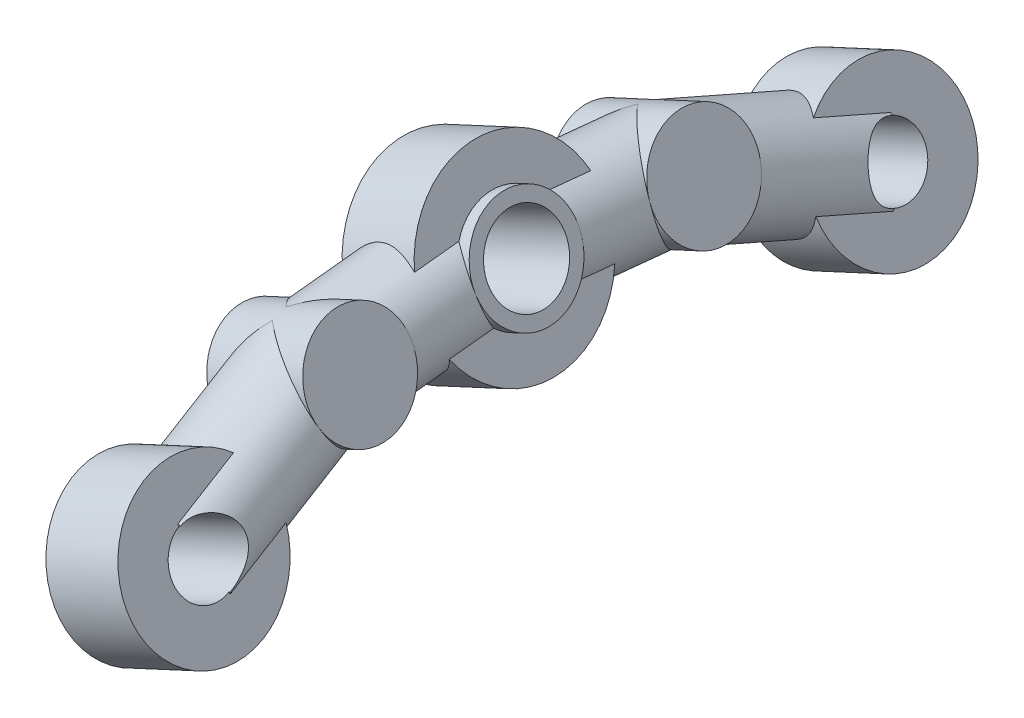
ISO-10303-21;
HEADER;
FILE_DESCRIPTION(('STEP AP214'),'2;1');
FILE_NAME('part.step','',(''),(''),'','','');
FILE_SCHEMA(('AUTOMOTIVE_DESIGN { 1 0 10303 214 1 1 1 1 }'));
ENDSEC;
DATA;
#1=APPLICATION_CONTEXT('core data for automotive mechanical design processes');
#2=APPLICATION_PROTOCOL_DEFINITION('international standard','automotive_design',2000,#1);
#3=PRODUCT_CONTEXT('',#1,'mechanical');
#4=PRODUCT('Part','Part','',(#3));
#5=PRODUCT_RELATED_PRODUCT_CATEGORY('part','',(#4));
#6=PRODUCT_DEFINITION_FORMATION('','',#4);
#7=PRODUCT_DEFINITION_CONTEXT('part definition',#1,'design');
#8=PRODUCT_DEFINITION('design','',#6,#7);
#9=PRODUCT_DEFINITION_SHAPE('','',#8);
#10=(LENGTH_UNIT() NAMED_UNIT(*) SI_UNIT(.MILLI.,.METRE.));
#11=(NAMED_UNIT(*) PLANE_ANGLE_UNIT() SI_UNIT($,.RADIAN.));
#12=(NAMED_UNIT(*) SI_UNIT($,.STERADIAN.) SOLID_ANGLE_UNIT());
#13=UNCERTAINTY_MEASURE_WITH_UNIT(LENGTH_MEASURE(1.E-05),#10,'distance_accuracy_value','');
#14=(GEOMETRIC_REPRESENTATION_CONTEXT(3) GLOBAL_UNCERTAINTY_ASSIGNED_CONTEXT((#13)) GLOBAL_UNIT_ASSIGNED_CONTEXT((#10,
#11,#12)) REPRESENTATION_CONTEXT('',''));
#15=CARTESIAN_POINT('',(0.,0.,0.));
#16=DIRECTION('',(0.,0.,1.));
#17=DIRECTION('',(1.,0.,0.));
#18=AXIS2_PLACEMENT_3D('',#15,#16,#17);
#19=CARTESIAN_POINT('',(430.955538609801,383.655199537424,26.));
#20=DIRECTION('',(0.151118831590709,-0.325621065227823,0.93334560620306));
#21=DIRECTION('',(0.,-0.944189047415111,-0.329404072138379));
#22=AXIS2_PLACEMENT_3D('',#19,#20,#21);
#23=PLANE('',#22);
#24=DIRECTION('',(0.907075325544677,0.420968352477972,0.));
#25=VECTOR('',#24,1.);
#26=CARTESIAN_POINT('',(428.309509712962,379.854789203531,25.1025523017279));
#27=LINE('',#26,#25);
#28=CARTESIAN_POINT('',(429.105469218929,380.224189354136,25.1025523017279));
#29=VERTEX_POINT('',#28);
#30=CARTESIAN_POINT('',(429.216585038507,380.275757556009,25.1025523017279));
#31=VERTEX_POINT('',#30);
#32=EDGE_CURVE('E127',#29,#31,#27,.T.);
#33=ORIENTED_EDGE('',*,*,#32,.F.);
#34=CARTESIAN_POINT('',(430.955538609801,383.655199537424,26.));
#35=DIRECTION('',(0.151118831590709,-0.325621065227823,0.93334560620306));
#36=DIRECTION('',(0.,-0.944189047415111,-0.329404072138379));
#37=AXIS2_PLACEMENT_3D('',#34,#35,#36);
#38=CIRCLE('',#37,3.99999999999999);
#39=CARTESIAN_POINT('',(429.273852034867,380.152362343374,25.0502306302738));
#40=VERTEX_POINT('',#39);
#41=EDGE_CURVE('E423',#29,#40,#38,.T.);
#42=ORIENTED_EDGE('',*,*,#41,.T.);
#43=DIRECTION('',(-0.392908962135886,0.846614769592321,0.358979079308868));
#44=VECTOR('',#43,1.);
#45=CARTESIAN_POINT('',(428.234312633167,382.39229447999,26.));
#46=LINE('',#45,#44);
#47=EDGE_CURVE('E352',#40,#31,#46,.T.);
#48=ORIENTED_EDGE('',*,*,#47,.T.);
#49=EDGE_LOOP('',(#33,#42,#48));
#50=FACE_BOUND('',#49,.T.);
#51=ADVANCED_FACE('F112',(#50),#23,.T.);
#52=DIRECTION('',(0.907075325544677,0.420968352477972,0.));
#53=VECTOR('',#52,1.);
#54=CARTESIAN_POINT('',(428.309509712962,379.854789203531,25.1025523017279));
#55=LINE('',#54,#53);
#56=CARTESIAN_POINT('',(434.659036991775,382.801567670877,25.1025523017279));
#57=VERTEX_POINT('',#56);
#58=CARTESIAN_POINT('',(434.770152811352,382.85313587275,25.1025523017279));
#59=VERTEX_POINT('',#58);
#60=EDGE_CURVE('E331',#57,#59,#55,.T.);
#61=ORIENTED_EDGE('',*,*,#60,.F.);
#62=DIRECTION('',(-0.392908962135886,0.846614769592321,0.358979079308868));
#63=VECTOR('',#62,1.);
#64=CARTESIAN_POINT('',(433.676764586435,384.918104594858,26.0000000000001));
#65=LINE('',#64,#63);
#66=CARTESIAN_POINT('',(434.716303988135,382.678172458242,25.0502306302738));
#67=VERTEX_POINT('',#66);
#68=EDGE_CURVE('E340',#67,#57,#65,.T.);
#69=ORIENTED_EDGE('',*,*,#68,.F.);
#70=EDGE_CURVE('E342',#67,#59,#38,.T.);
#71=ORIENTED_EDGE('',*,*,#70,.T.);
#72=EDGE_LOOP('',(#61,#69,#71));
#73=FACE_BOUND('',#72,.T.);
#74=ADVANCED_FACE('F339',(#73),#23,.T.);
#75=CARTESIAN_POINT('',(430.955538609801,383.655199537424,-25.9999999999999));
#76=DIRECTION('',(-0.151118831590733,0.325621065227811,0.93334560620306));
#77=DIRECTION('',(0.,-0.944189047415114,0.329404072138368));
#78=AXIS2_PLACEMENT_3D('',#75,#76,#77);
#79=PLANE('',#78);
#80=CARTESIAN_POINT('',(430.955538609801,383.655199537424,-25.9999999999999));
#81=DIRECTION('',(-0.151118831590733,0.325621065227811,0.93334560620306));
#82=DIRECTION('',(0.,-0.944189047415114,0.329404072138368));
#83=AXIS2_PLACEMENT_3D('',#80,#81,#82);
#84=CIRCLE('',#83,4.);
#85=CARTESIAN_POINT('',(429.105469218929,380.224189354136,-25.1025523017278));
#86=VERTEX_POINT('',#85);
#87=CARTESIAN_POINT('',(429.273852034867,380.152362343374,-25.0502306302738));
#88=VERTEX_POINT('',#87);
#89=EDGE_CURVE('E421',#86,#88,#84,.T.);
#90=ORIENTED_EDGE('',*,*,#89,.F.);
#91=DIRECTION('',(0.907075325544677,0.420968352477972,0.));
#92=VECTOR('',#91,1.);
#93=CARTESIAN_POINT('',(428.309509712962,379.854789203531,-25.1025523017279));
#94=LINE('',#93,#92);
#95=CARTESIAN_POINT('',(429.216585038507,380.275757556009,-25.1025523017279));
#96=VERTEX_POINT('',#95);
#97=EDGE_CURVE('E699',#86,#96,#94,.T.);
#98=ORIENTED_EDGE('',*,*,#97,.T.);
#99=DIRECTION('',(-0.392908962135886,0.846614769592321,-0.358979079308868));
#100=VECTOR('',#99,1.);
#101=CARTESIAN_POINT('',(428.234312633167,382.39229447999,-26.));
#102=LINE('',#101,#100);
#103=EDGE_CURVE('E370',#88,#96,#102,.T.);
#104=ORIENTED_EDGE('',*,*,#103,.F.);
#105=EDGE_LOOP('',(#90,#98,#104));
#106=FACE_BOUND('',#105,.T.);
#107=ADVANCED_FACE('F599',(#106),#79,.F.);
#108=DIRECTION('',(-0.392908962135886,0.846614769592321,-0.358979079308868));
#109=VECTOR('',#108,1.);
#110=CARTESIAN_POINT('',(433.676764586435,384.918104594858,-25.9999999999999));
#111=LINE('',#110,#109);
#112=CARTESIAN_POINT('',(434.716303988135,382.678172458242,-25.0502306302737));
#113=VERTEX_POINT('',#112);
#114=CARTESIAN_POINT('',(434.659036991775,382.801567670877,-25.1025523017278));
#115=VERTEX_POINT('',#114);
#116=EDGE_CURVE('E366',#113,#115,#111,.T.);
#117=ORIENTED_EDGE('',*,*,#116,.T.);
#118=DIRECTION('',(0.907075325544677,0.420968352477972,0.));
#119=VECTOR('',#118,1.);
#120=CARTESIAN_POINT('',(428.309509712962,379.854789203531,-25.1025523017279));
#121=LINE('',#120,#119);
#122=CARTESIAN_POINT('',(434.770152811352,382.85313587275,-25.1025523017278));
#123=VERTEX_POINT('',#122);
#124=EDGE_CURVE('E714',#115,#123,#121,.T.);
#125=ORIENTED_EDGE('',*,*,#124,.T.);
#126=EDGE_CURVE('E425',#113,#123,#84,.T.);
#127=ORIENTED_EDGE('',*,*,#126,.F.);
#128=EDGE_LOOP('',(#117,#125,#127));
#129=FACE_BOUND('',#128,.T.);
#130=ADVANCED_FACE('F590',(#129),#79,.F.);
#131=CARTESIAN_POINT('',(428.850696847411,388.190576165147,-13.));
#132=DIRECTION('',(-0.0322867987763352,0.0695695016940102,0.997054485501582));
#133=DIRECTION('',(0.,-0.997574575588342,0.069605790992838));
#134=AXIS2_PLACEMENT_3D('',#131,#132,#133);
#135=CYLINDRICAL_SURFACE('',#134,4.00000000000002);
#136=CARTESIAN_POINT('',(428.850696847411,388.190576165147,-13.));
#137=DIRECTION('',(0.618568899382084,0.346862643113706,0.705023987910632));
#138=DIRECTION('',(-0.664229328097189,-0.248476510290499,0.705023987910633));
#139=AXIS2_PLACEMENT_3D('',#136,#137,#138);
#140=ELLIPSE('',#139,5.65685424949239,4.00000000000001);
#141=CARTESIAN_POINT('',(429.968272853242,384.40765337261,-12.1193819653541));
#142=VERTEX_POINT('',#141);
#143=CARTESIAN_POINT('',(425.093248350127,386.784980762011,-9.01178205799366));
#144=VERTEX_POINT('',#143);
#145=EDGE_CURVE('E441',#142,#144,#140,.F.);
#146=ORIENTED_EDGE('',*,*,#145,.F.);
#147=CARTESIAN_POINT('',(428.850696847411,388.190576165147,-12.9999999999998));
#148=DIRECTION('',(-0.0926780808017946,0.199696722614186,0.975465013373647));
#149=DIRECTION('',(-0.41063989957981,0.884820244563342,-0.220154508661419));
#150=AXIS2_PLACEMENT_3D('',#147,#148,#149);
#151=ELLIPSE('',#150,4.04254026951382,4.00000000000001);
#152=CARTESIAN_POINT('',(431.018240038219,384.894937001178,-12.1193819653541));
#153=VERTEX_POINT('',#152);
#154=EDGE_CURVE('E428',#142,#153,#151,.T.);
#155=ORIENTED_EDGE('',*,*,#154,.T.);
#156=CARTESIAN_POINT('',(428.850696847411,388.190576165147,-13.));
#157=DIRECTION('',(-0.664229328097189,-0.248476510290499,0.705023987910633));
#158=DIRECTION('',(0.618568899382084,0.346862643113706,0.705023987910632));
#159=AXIS2_PLACEMENT_3D('',#156,#157,#158);
#160=ELLIPSE('',#159,5.6568542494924,4.00000000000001);
#161=CARTESIAN_POINT('',(432.349850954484,390.152727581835,-9.01178205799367));
#162=VERTEX_POINT('',#161);
#163=EDGE_CURVE('E434',#162,#153,#160,.F.);
#164=ORIENTED_EDGE('',*,*,#163,.F.);
#165=CARTESIAN_POINT('',(427.171783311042,391.808190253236,-13.306785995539));
#166=VERTEX_POINT('',#165);
#167=EDGE_CURVE('E437',#166,#162,#160,.F.);
#168=ORIENTED_EDGE('',*,*,#167,.F.);
#169=EDGE_CURVE('E438',#144,#166,#140,.F.);
#170=ORIENTED_EDGE('',*,*,#169,.F.);
#171=EDGE_LOOP('',(#146,#155,#164,#168,#170));
#172=FACE_BOUND('',#171,.T.);
#173=CARTESIAN_POINT('',(427.028241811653,384.99105772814,-6.25873172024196));
#174=CARTESIAN_POINT('',(427.130852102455,384.94814116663,-6.21759868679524));
#175=CARTESIAN_POINT('',(427.235157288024,384.909750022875,-6.17613484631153));
#176=CARTESIAN_POINT('',(427.44680525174,384.84207659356,-6.09344404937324));
#177=CARTESIAN_POINT('',(427.554148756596,384.812796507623,-6.05221715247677));
#178=CARTESIAN_POINT('',(427.881800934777,384.738358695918,-5.92964649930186));
#179=CARTESIAN_POINT('',(428.106144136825,384.707265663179,-5.85007253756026));
#180=CARTESIAN_POINT('',(428.56208835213,384.683717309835,-5.7041558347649));
#181=CARTESIAN_POINT('',(428.793708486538,384.691374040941,-5.63785204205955));
#182=CARTESIAN_POINT('',(429.141027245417,384.732854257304,-5.555724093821));
#183=CARTESIAN_POINT('',(429.256619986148,384.751633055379,-5.53125823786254));
#184=CARTESIAN_POINT('',(429.487007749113,384.799195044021,-5.4890739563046));
#185=CARTESIAN_POINT('',(429.601802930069,384.827976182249,-5.47135414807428));
#186=CARTESIAN_POINT('',(429.816531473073,384.891617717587,-5.44511484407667));
#187=CARTESIAN_POINT('',(429.91667927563,384.925424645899,-5.43578238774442));
#188=CARTESIAN_POINT('',(430.114495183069,385.000597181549,-5.423506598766));
#189=CARTESIAN_POINT('',(430.212163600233,385.041961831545,-5.42056245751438));
#190=CARTESIAN_POINT('',(430.40412276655,385.131902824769,-5.42119563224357));
#191=CARTESIAN_POINT('',(430.498412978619,385.180480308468,-5.42477398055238));
#192=CARTESIAN_POINT('',(430.682713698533,385.284337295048,-5.43828468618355));
#193=CARTESIAN_POINT('',(430.772724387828,385.339616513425,-5.4482167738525));
#194=CARTESIAN_POINT('',(431.013924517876,385.500498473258,-5.48382353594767));
#195=CARTESIAN_POINT('',(431.159971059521,385.612574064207,-5.51572256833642));
#196=CARTESIAN_POINT('',(431.433718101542,385.852641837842,-5.59431827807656));
#197=CARTESIAN_POINT('',(431.561407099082,385.980643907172,-5.64102417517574));
#198=CARTESIAN_POINT('',(431.809135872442,386.263882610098,-5.75022730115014));
#199=CARTESIAN_POINT('',(431.927010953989,386.420566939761,-5.81385953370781));
#200=CARTESIAN_POINT('',(432.137282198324,386.747302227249,-5.94803926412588));
#201=CARTESIAN_POINT('',(432.229696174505,386.917343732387,-6.01858188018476));
#202=CARTESIAN_POINT('',(432.339980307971,387.161947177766,-6.11802155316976));
#203=CARTESIAN_POINT('',(432.369075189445,387.23189163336,-6.14623705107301));
#204=CARTESIAN_POINT('',(432.423043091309,387.373263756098,-6.20259525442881));
#205=CARTESIAN_POINT('',(432.447923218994,387.444688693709,-6.23073800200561));
#206=CARTESIAN_POINT('',(432.470693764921,387.516867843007,-6.25873172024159));
#207=B_SPLINE_CURVE_WITH_KNOTS('',3,(#173,#174,#175,#176,#177,#178,#179,#180,#181,#182,#183,
#184,#185,#186,#187,#188,#189,#190,#191,#192,#193,#194,#195,#196,#197,#198,#199,#200,#201,#202,
#203,#204,#205,#206),.UNSPECIFIED.,.F.,.F.,(4,2,2,2,2,2,2,2,2,2,2,2,2,2,2,2,4),(0.,
0.355549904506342,0.711185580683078,1.4279173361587,2.14672282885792,2.50512435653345,
2.86345238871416,3.18131765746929,3.49914268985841,3.81701802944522,4.13487987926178,
4.6928316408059,5.25113150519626,5.86729994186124,6.48303618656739,6.72545410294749,
6.96745907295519),.UNSPECIFIED.);
#208=CARTESIAN_POINT('',(427.028241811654,384.99105772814,-6.25873172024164));
#209=VERTEX_POINT('',#208);
#210=CARTESIAN_POINT('',(432.470693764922,387.516867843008,-6.25873172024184));
#211=VERTEX_POINT('',#210);
#212=EDGE_CURVE('E580',#209,#211,#207,.T.);
#213=ORIENTED_EDGE('',*,*,#212,.F.);
#214=DIRECTION('',(-0.0322867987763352,0.0695695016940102,0.997054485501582));
#215=VECTOR('',#214,1.);
#216=CARTESIAN_POINT('',(427.239967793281,384.534844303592,-12.7970801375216));
#217=LINE('',#216,#215);
#218=CARTESIAN_POINT('',(426.915859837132,385.233211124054,-2.78824359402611));
#219=VERTEX_POINT('',#218);
#220=EDGE_CURVE('E685',#209,#219,#217,.T.);
#221=ORIENTED_EDGE('',*,*,#220,.T.);
#222=CARTESIAN_POINT('',(428.429728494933,389.097651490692,0.));
#223=DIRECTION('',(-0.664229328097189,-0.248476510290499,0.705023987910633));
#224=DIRECTION('',(0.618568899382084,0.346862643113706,0.705023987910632));
#225=AXIS2_PLACEMENT_3D('',#222,#223,#224);
#226=ELLIPSE('',#225,5.6568542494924,4.00000000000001);
#227=CARTESIAN_POINT('',(424.93057438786,387.135500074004,-3.98821794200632));
#228=VERTEX_POINT('',#227);
#229=EDGE_CURVE('E397',#228,#219,#226,.T.);
#230=ORIENTED_EDGE('',*,*,#229,.F.);
#231=CARTESIAN_POINT('',(424.694865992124,390.018864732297,-3.19408331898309));
#232=VERTEX_POINT('',#231);
#233=EDGE_CURVE('E400',#232,#228,#226,.T.);
#234=ORIENTED_EDGE('',*,*,#233,.F.);
#235=DIRECTION('',(-0.0322867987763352,0.0695695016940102,0.997054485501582));
#236=VECTOR('',#235,1.);
#237=CARTESIAN_POINT('',(425.018973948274,389.320497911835,-13.2029198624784));
#238=LINE('',#237,#236);
#239=CARTESIAN_POINT('',(424.807247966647,389.776711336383,-6.66457144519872));
#240=VERTEX_POINT('',#239);
#241=EDGE_CURVE('E679',#232,#240,#238,.F.);
#242=ORIENTED_EDGE('',*,*,#241,.T.);
#243=CARTESIAN_POINT('',(430.249699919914,392.302521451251,-6.66457144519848));
#244=CARTESIAN_POINT('',(430.144848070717,392.350267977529,-6.63648250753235));
#245=CARTESIAN_POINT('',(430.038263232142,392.393571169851,-6.60754797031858));
#246=CARTESIAN_POINT('',(429.822036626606,392.471110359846,-6.54884489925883));
#247=CARTESIAN_POINT('',(429.712394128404,392.505344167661,-6.51907616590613));
#248=CARTESIAN_POINT('',(429.377867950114,392.594593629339,-6.42936957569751));
#249=CARTESIAN_POINT('',(429.149008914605,392.635417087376,-6.36948926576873));
#250=CARTESIAN_POINT('',(428.684726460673,392.676932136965,-6.25791131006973));
#251=CARTESIAN_POINT('',(428.449285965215,392.677507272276,-6.20623784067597));
#252=CARTESIAN_POINT('',(428.097217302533,392.646261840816,-6.14168314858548));
#253=CARTESIAN_POINT('',(427.980206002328,392.630539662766,-6.12234221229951));
#254=CARTESIAN_POINT('',(427.747368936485,392.588255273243,-6.08888912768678));
#255=CARTESIAN_POINT('',(427.631542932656,392.561695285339,-6.07477590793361));
#256=CARTESIAN_POINT('',(427.415286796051,392.501345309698,-6.05384131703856));
#257=CARTESIAN_POINT('',(427.314595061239,392.468710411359,-6.04637650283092));
#258=CARTESIAN_POINT('',(427.116063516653,392.395079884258,-6.03655257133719));
#259=CARTESIAN_POINT('',(427.018223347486,392.354085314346,-6.03419280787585));
#260=CARTESIAN_POINT('',(426.826301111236,392.264064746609,-6.03470007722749));
#261=CARTESIAN_POINT('',(426.732219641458,392.215037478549,-6.03756793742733));
#262=CARTESIAN_POINT('',(426.548706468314,392.109483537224,-6.0483776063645));
#263=CARTESIAN_POINT('',(426.459274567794,392.052957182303,-6.056319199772));
#264=CARTESIAN_POINT('',(426.220147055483,391.887609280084,-6.0847173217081));
#265=CARTESIAN_POINT('',(426.075955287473,391.771537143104,-6.110095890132));
#266=CARTESIAN_POINT('',(425.806760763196,391.521659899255,-6.17208730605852));
#267=CARTESIAN_POINT('',(425.681770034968,391.38784377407,-6.20870715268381));
#268=CARTESIAN_POINT('',(425.440316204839,391.091084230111,-6.29328168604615));
#269=CARTESIAN_POINT('',(425.326079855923,390.926559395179,-6.34201781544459));
#270=CARTESIAN_POINT('',(425.123418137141,390.583427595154,-6.44282922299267));
#271=CARTESIAN_POINT('',(425.03497471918,390.404830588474,-6.4949021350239));
#272=CARTESIAN_POINT('',(424.930223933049,390.148304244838,-6.56633876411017));
#273=CARTESIAN_POINT('',(424.902692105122,390.074991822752,-6.58639220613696));
#274=CARTESIAN_POINT('',(424.851830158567,389.926927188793,-6.62594957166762));
#275=CARTESIAN_POINT('',(424.828492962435,389.852177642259,-6.64545437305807));
#276=CARTESIAN_POINT('',(424.807247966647,389.776711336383,-6.66457144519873));
#277=B_SPLINE_CURVE_WITH_KNOTS('',3,(#243,#244,#245,#246,#247,#248,#249,#250,#251,#252,#253,
#254,#255,#256,#257,#258,#259,#260,#261,#262,#263,#264,#265,#266,#267,#268,#269,#270,#271,#272,
#273,#274,#275,#276),.UNSPECIFIED.,.F.,.F.,(4,2,2,2,2,2,2,2,2,2,2,2,2,2,2,2,4),(0.,
0.355549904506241,0.711185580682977,1.42791733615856,2.14672282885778,2.50512435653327,
2.86345238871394,3.18131765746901,3.49914268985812,3.81701802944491,4.13487987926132,
4.69283164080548,5.25113150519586,5.86729994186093,6.48303618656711,6.72545410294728,
6.96745907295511),.UNSPECIFIED.);
#278=CARTESIAN_POINT('',(430.249699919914,392.302521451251,-6.66457144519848));
#279=VERTEX_POINT('',#278);
#280=EDGE_CURVE('E573',#279,#240,#277,.T.);
#281=ORIENTED_EDGE('',*,*,#280,.F.);
#282=DIRECTION('',(-0.0322867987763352,0.0695695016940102,0.997054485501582));
#283=VECTOR('',#282,1.);
#284=CARTESIAN_POINT('',(430.461425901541,391.846308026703,-13.2029198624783));
#285=LINE('',#284,#283);
#286=CARTESIAN_POINT('',(430.137317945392,392.544674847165,-3.19408331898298));
#287=VERTEX_POINT('',#286);
#288=EDGE_CURVE('E671',#287,#279,#285,.F.);
#289=ORIENTED_EDGE('',*,*,#288,.F.);
#290=CARTESIAN_POINT('',(428.429728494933,389.097651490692,0.));
#291=DIRECTION('',(0.618568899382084,0.346862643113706,0.705023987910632));
#292=DIRECTION('',(-0.664229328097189,-0.248476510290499,0.705023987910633));
#293=AXIS2_PLACEMENT_3D('',#290,#291,#292);
#294=ELLIPSE('',#293,5.65685424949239,4.00000000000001);
#295=CARTESIAN_POINT('',(432.187176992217,390.503246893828,-3.98821794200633));
#296=VERTEX_POINT('',#295);
#297=EDGE_CURVE('E401',#296,#287,#294,.T.);
#298=ORIENTED_EDGE('',*,*,#297,.F.);
#299=CARTESIAN_POINT('',(432.3583117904,387.759021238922,-2.7882435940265));
#300=VERTEX_POINT('',#299);
#301=EDGE_CURVE('E403',#300,#296,#294,.T.);
#302=ORIENTED_EDGE('',*,*,#301,.F.);
#303=DIRECTION('',(-0.0322867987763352,0.0695695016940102,0.997054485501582));
#304=VECTOR('',#303,1.);
#305=CARTESIAN_POINT('',(432.682419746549,387.06065441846,-12.7970801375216));
#306=LINE('',#305,#304);
#307=EDGE_CURVE('E581',#211,#300,#306,.T.);
#308=ORIENTED_EDGE('',*,*,#307,.F.);
#309=EDGE_LOOP('',(#213,#221,#230,#234,#242,#281,#289,#298,#302,#308));
#310=FACE_BOUND('',#309,.T.);
#311=ADVANCED_FACE('F587',(#172,#310),#135,.T.);
#312=CARTESIAN_POINT('',(428.429728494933,389.097651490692,0.));
#313=DIRECTION('',(0.0322867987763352,-0.0695695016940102,0.997054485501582));
#314=DIRECTION('',(0.,-0.997574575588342,-0.069605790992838));
#315=AXIS2_PLACEMENT_3D('',#312,#313,#314);
#316=CYLINDRICAL_SURFACE('',#315,4.00000000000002);
#317=CARTESIAN_POINT('',(428.850696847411,388.190576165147,13.));
#318=DIRECTION('',(0.664229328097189,0.248476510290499,0.705023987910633));
#319=DIRECTION('',(-0.618568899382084,-0.346862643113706,0.705023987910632));
#320=AXIS2_PLACEMENT_3D('',#317,#318,#319);
#321=ELLIPSE('',#320,5.6568542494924,4.00000000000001);
#322=CARTESIAN_POINT('',(431.018240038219,384.894937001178,12.1193819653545));
#323=VERTEX_POINT('',#322);
#324=CARTESIAN_POINT('',(432.349850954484,390.152727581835,9.01178205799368));
#325=VERTEX_POINT('',#324);
#326=EDGE_CURVE('E388',#323,#325,#321,.T.);
#327=ORIENTED_EDGE('',*,*,#326,.F.);
#328=CARTESIAN_POINT('',(428.850696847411,388.190576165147,13.0000000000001));
#329=DIRECTION('',(0.0926780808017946,-0.199696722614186,0.975465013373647));
#330=DIRECTION('',(-0.41063989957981,0.884820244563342,0.220154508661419));
#331=AXIS2_PLACEMENT_3D('',#328,#329,#330);
#332=ELLIPSE('',#331,4.04254026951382,4.);
#333=CARTESIAN_POINT('',(429.968272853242,384.40765337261,12.1193819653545));
#334=VERTEX_POINT('',#333);
#335=EDGE_CURVE('E432',#334,#323,#332,.T.);
#336=ORIENTED_EDGE('',*,*,#335,.F.);
#337=CARTESIAN_POINT('',(428.850696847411,388.190576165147,13.));
#338=DIRECTION('',(-0.618568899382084,-0.346862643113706,0.705023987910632));
#339=DIRECTION('',(0.664229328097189,0.248476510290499,0.705023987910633));
#340=AXIS2_PLACEMENT_3D('',#337,#338,#339);
#341=ELLIPSE('',#340,5.65685424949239,4.00000000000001);
#342=CARTESIAN_POINT('',(425.093248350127,386.784980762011,9.01178205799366));
#343=VERTEX_POINT('',#342);
#344=EDGE_CURVE('E381',#343,#334,#341,.T.);
#345=ORIENTED_EDGE('',*,*,#344,.F.);
#346=CARTESIAN_POINT('',(427.171783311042,391.808190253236,13.3067859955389));
#347=VERTEX_POINT('',#346);
#348=EDGE_CURVE('E384',#347,#343,#341,.T.);
#349=ORIENTED_EDGE('',*,*,#348,.F.);
#350=EDGE_CURVE('E385',#325,#347,#321,.T.);
#351=ORIENTED_EDGE('',*,*,#350,.F.);
#352=EDGE_LOOP('',(#327,#336,#345,#349,#351));
#353=FACE_BOUND('',#352,.T.);
#354=CARTESIAN_POINT('',(424.807247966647,389.776711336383,6.66457144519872));
#355=CARTESIAN_POINT('',(424.838473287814,389.887610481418,6.63648250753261));
#356=CARTESIAN_POINT('',(424.874210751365,389.996964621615,6.60754797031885));
#357=CARTESIAN_POINT('',(424.954583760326,390.212153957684,6.54884489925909));
#358=CARTESIAN_POINT('',(424.999221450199,390.317988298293,6.51907616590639));
#359=CARTESIAN_POINT('',(425.147022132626,390.631082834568,6.42936957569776));
#360=CARTESIAN_POINT('',(425.26359008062,390.83221693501,6.36948926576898));
#361=CARTESIAN_POINT('',(425.531612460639,391.213590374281,6.25791131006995));
#362=CARTESIAN_POINT('',(425.683166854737,391.393767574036,6.20623784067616));
#363=CARTESIAN_POINT('',(425.934314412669,391.642471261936,6.14168314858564));
#364=CARTESIAN_POINT('',(426.021860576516,391.721683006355,6.12234221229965));
#365=CARTESIAN_POINT('',(426.204466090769,391.872203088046,6.0888891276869));
#366=CARTESIAN_POINT('',(426.299523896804,391.943513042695,6.07477590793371));
#367=CARTESIAN_POINT('',(426.485221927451,392.06970764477,6.05384131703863));
#368=CARTESIAN_POINT('',(426.575148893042,392.125537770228,6.04637650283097));
#369=CARTESIAN_POINT('',(426.759546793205,392.229622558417,6.03655257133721));
#370=CARTESIAN_POINT('',(426.854017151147,392.27787817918,6.03419280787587));
#371=CARTESIAN_POINT('',(427.046665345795,392.366334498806,6.03470007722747));
#372=CARTESIAN_POINT('',(427.144843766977,392.40653392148,6.0375679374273));
#373=CARTESIAN_POINT('',(427.343926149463,392.478540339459,6.04837760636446));
#374=CARTESIAN_POINT('',(427.444829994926,392.510347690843,6.05631919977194));
#375=CARTESIAN_POINT('',(427.725480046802,392.586225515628,6.08471732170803));
#376=CARTESIAN_POINT('',(427.907210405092,392.62141193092,6.11009589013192));
#377=CARTESIAN_POINT('',(428.271825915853,392.665682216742,6.17208730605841));
#378=CARTESIAN_POINT('',(428.454711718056,392.674749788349,6.20870715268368));
#379=CARTESIAN_POINT('',(428.837222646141,392.667568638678,6.29328168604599));
#380=CARTESIAN_POINT('',(429.036617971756,392.648598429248,6.34201781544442));
#381=CARTESIAN_POINT('',(429.429500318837,392.581855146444,6.44282922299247));
#382=CARTESIAN_POINT('',(429.622991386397,392.534102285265,6.4949021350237));
#383=CARTESIAN_POINT('',(429.88652465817,392.448494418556,6.56633876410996));
#384=CARTESIAN_POINT('',(429.960287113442,392.422192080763,6.58639220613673));
#385=CARTESIAN_POINT('',(430.106199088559,392.365449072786,6.62594957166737));
#386=CARTESIAN_POINT('',(430.178351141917,392.335015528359,6.64545437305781));
#387=CARTESIAN_POINT('',(430.249699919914,392.302521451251,6.66457144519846));
#388=B_SPLINE_CURVE_WITH_KNOTS('',3,(#354,#355,#356,#357,#358,#359,#360,#361,#362,#363,#364,
#365,#366,#367,#368,#369,#370,#371,#372,#373,#374,#375,#376,#377,#378,#379,#380,#381,#382,#383,
#384,#385,#386,#387),.UNSPECIFIED.,.F.,.F.,(4,2,2,2,2,2,2,2,2,2,2,2,2,2,2,2,4),(0.,
0.355549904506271,0.711185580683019,1.42791733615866,2.14672282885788,2.50512435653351,
2.86345238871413,3.18131765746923,3.49914268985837,3.81701802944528,4.1348798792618,
4.692831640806,5.25113150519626,5.86729994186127,6.48303618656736,6.72545410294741,
6.96745907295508),.UNSPECIFIED.);
#389=CARTESIAN_POINT('',(424.807247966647,389.776711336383,6.66457144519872));
#390=VERTEX_POINT('',#389);
#391=CARTESIAN_POINT('',(430.249699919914,392.302521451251,6.66457144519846));
#392=VERTEX_POINT('',#391);
#393=EDGE_CURVE('E550',#390,#392,#388,.T.);
#394=ORIENTED_EDGE('',*,*,#393,.F.);
#395=DIRECTION('',(0.0322867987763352,-0.0695695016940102,0.997054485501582));
#396=VECTOR('',#395,1.);
#397=CARTESIAN_POINT('',(424.598005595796,390.227573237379,0.20291986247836));
#398=LINE('',#397,#396);
#399=CARTESIAN_POINT('',(424.694865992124,390.018864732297,3.19408331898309));
#400=VERTEX_POINT('',#399);
#401=EDGE_CURVE('E681',#390,#400,#398,.F.);
#402=ORIENTED_EDGE('',*,*,#401,.T.);
#403=CARTESIAN_POINT('',(428.429728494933,389.097651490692,0.));
#404=DIRECTION('',(0.664229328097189,0.248476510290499,0.705023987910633));
#405=DIRECTION('',(-0.618568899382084,-0.346862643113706,0.705023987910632));
#406=AXIS2_PLACEMENT_3D('',#403,#404,#405);
#407=ELLIPSE('',#406,5.6568542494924,4.00000000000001);
#408=CARTESIAN_POINT('',(424.93057438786,387.135500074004,3.98821794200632));
#409=VERTEX_POINT('',#408);
#410=EDGE_CURVE('E446',#409,#400,#407,.F.);
#411=ORIENTED_EDGE('',*,*,#410,.F.);
#412=CARTESIAN_POINT('',(426.915859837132,385.233211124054,2.78824359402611));
#413=VERTEX_POINT('',#412);
#414=EDGE_CURVE('E449',#413,#409,#407,.F.);
#415=ORIENTED_EDGE('',*,*,#414,.F.);
#416=DIRECTION('',(0.0322867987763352,-0.0695695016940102,0.997054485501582));
#417=VECTOR('',#416,1.);
#418=CARTESIAN_POINT('',(426.818999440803,385.441919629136,-0.202919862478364));
#419=LINE('',#418,#417);
#420=CARTESIAN_POINT('',(427.028241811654,384.99105772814,6.25873172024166));
#421=VERTEX_POINT('',#420);
#422=EDGE_CURVE('E665',#413,#421,#419,.T.);
#423=ORIENTED_EDGE('',*,*,#422,.T.);
#424=CARTESIAN_POINT('',(432.470693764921,387.516867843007,6.25873172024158));
#425=CARTESIAN_POINT('',(432.437226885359,387.41079866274,6.21759868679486));
#426=CARTESIAN_POINT('',(432.399209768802,387.30635657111,6.17613484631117));
#427=CARTESIAN_POINT('',(432.314258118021,387.101032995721,6.09344404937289));
#428=CARTESIAN_POINT('',(432.267321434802,387.00015237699,6.05221715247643));
#429=CARTESIAN_POINT('',(432.112646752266,386.701869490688,5.92964649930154));
#430=CARTESIAN_POINT('',(431.991562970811,386.510465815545,5.85007253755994));
#431=CARTESIAN_POINT('',(431.715202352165,386.147059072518,5.70415583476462));
#432=CARTESIAN_POINT('',(431.559827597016,385.975113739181,5.63785204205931));
#433=CARTESIAN_POINT('',(431.303930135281,385.736644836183,5.5557240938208));
#434=CARTESIAN_POINT('',(431.214965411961,385.660489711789,5.53125823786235));
#435=CARTESIAN_POINT('',(431.029910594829,385.515247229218,5.48907395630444));
#436=CARTESIAN_POINT('',(430.933821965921,385.446158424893,5.47135414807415));
#437=CARTESIAN_POINT('',(430.746596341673,385.323255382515,5.44511484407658));
#438=CARTESIAN_POINT('',(430.656125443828,385.26859728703,5.43578238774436));
#439=CARTESIAN_POINT('',(430.471011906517,385.16605450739,5.42350659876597));
#440=CARTESIAN_POINT('',(430.376369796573,385.118168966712,5.42056245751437));
#441=CARTESIAN_POINT('',(430.183758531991,385.029633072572,5.42119563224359));
#442=CARTESIAN_POINT('',(430.0857888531,384.988983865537,5.42477398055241));
#443=CARTESIAN_POINT('',(429.887494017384,384.915280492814,5.43828468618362));
#444=CARTESIAN_POINT('',(429.787168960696,384.882226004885,5.44821677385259));
#445=CARTESIAN_POINT('',(429.508591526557,384.801882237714,5.48382353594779));
#446=CARTESIAN_POINT('',(429.328715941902,384.762699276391,5.51572256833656));
#447=CARTESIAN_POINT('',(428.968652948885,384.708619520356,5.59431827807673));
#448=CARTESIAN_POINT('',(428.788465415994,384.693737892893,5.64102417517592));
#449=CARTESIAN_POINT('',(428.41222943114,384.687398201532,5.75022730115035));
#450=CARTESIAN_POINT('',(428.216472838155,384.698527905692,5.81385953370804));
#451=CARTESIAN_POINT('',(427.831200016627,384.74887467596,5.94803926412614));
#452=CARTESIAN_POINT('',(427.641679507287,384.788072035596,6.01858188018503));
#453=CARTESIAN_POINT('',(427.383679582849,384.861757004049,6.11802155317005));
#454=CARTESIAN_POINT('',(427.311480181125,384.88469137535,6.14623705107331));
#455=CARTESIAN_POINT('',(427.168674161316,384.934741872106,6.20259525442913));
#456=CARTESIAN_POINT('',(427.098065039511,384.96185080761,6.23073800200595));
#457=CARTESIAN_POINT('',(427.028241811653,384.99105772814,6.25873172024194));
#458=B_SPLINE_CURVE_WITH_KNOTS('',3,(#424,#425,#426,#427,#428,#429,#430,#431,#432,#433,#434,
#435,#436,#437,#438,#439,#440,#441,#442,#443,#444,#445,#446,#447,#448,#449,#450,#451,#452,#453,
#454,#455,#456,#457),.UNSPECIFIED.,.F.,.F.,(4,2,2,2,2,2,2,2,2,2,2,2,2,2,2,2,4),(0.,
0.355549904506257,0.71118558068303,1.42791733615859,2.1467228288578,2.50512435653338,
2.86345238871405,3.1813176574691,3.49914268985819,3.81701802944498,4.13487987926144,
4.69283164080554,5.25113150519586,5.86729994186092,6.48303618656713,6.72545410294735,
6.96745907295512),.UNSPECIFIED.);
#459=CARTESIAN_POINT('',(432.470693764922,387.516867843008,6.25873172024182));
#460=VERTEX_POINT('',#459);
#461=EDGE_CURVE('E542',#460,#421,#458,.T.);
#462=ORIENTED_EDGE('',*,*,#461,.F.);
#463=DIRECTION('',(0.0322867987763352,-0.0695695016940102,0.997054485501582));
#464=VECTOR('',#463,1.);
#465=CARTESIAN_POINT('',(432.26145139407,387.967729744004,-0.202919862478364));
#466=LINE('',#465,#464);
#467=CARTESIAN_POINT('',(432.3583117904,387.759021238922,2.78824359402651));
#468=VERTEX_POINT('',#467);
#469=EDGE_CURVE('E664',#468,#460,#466,.T.);
#470=ORIENTED_EDGE('',*,*,#469,.F.);
#471=CARTESIAN_POINT('',(428.429728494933,389.097651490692,0.));
#472=DIRECTION('',(-0.618568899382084,-0.346862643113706,0.705023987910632));
#473=DIRECTION('',(0.664229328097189,0.248476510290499,0.705023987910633));
#474=AXIS2_PLACEMENT_3D('',#471,#472,#473);
#475=ELLIPSE('',#474,5.65685424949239,4.00000000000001);
#476=CARTESIAN_POINT('',(432.187176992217,390.503246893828,3.98821794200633));
#477=VERTEX_POINT('',#476);
#478=EDGE_CURVE('E442',#477,#468,#475,.F.);
#479=ORIENTED_EDGE('',*,*,#478,.F.);
#480=CARTESIAN_POINT('',(430.137317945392,392.544674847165,3.19408331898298));
#481=VERTEX_POINT('',#480);
#482=EDGE_CURVE('E445',#481,#477,#475,.F.);
#483=ORIENTED_EDGE('',*,*,#482,.F.);
#484=DIRECTION('',(0.0322867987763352,-0.0695695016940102,0.997054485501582));
#485=VECTOR('',#484,1.);
#486=CARTESIAN_POINT('',(430.040457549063,392.753383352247,0.20291986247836));
#487=LINE('',#486,#485);
#488=EDGE_CURVE('E676',#392,#481,#487,.F.);
#489=ORIENTED_EDGE('',*,*,#488,.F.);
#490=EDGE_LOOP('',(#394,#402,#411,#415,#423,#462,#470,#479,#483,#489));
#491=FACE_BOUND('',#490,.T.);
#492=ADVANCED_FACE('F555',(#353,#491),#316,.T.);
#493=CARTESIAN_POINT('',(424.801427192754,387.41377808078,0.));
#494=DIRECTION('',(0.907075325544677,0.420968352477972,0.));
#495=DIRECTION('',(-0.420968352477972,0.907075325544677,0.));
#496=AXIS2_PLACEMENT_3D('',#493,#494,#495);
#497=CYLINDRICAL_SURFACE('',#496,4.);
#498=ORIENTED_EDGE('',*,*,#410,.T.);
#499=CARTESIAN_POINT('',(425.708502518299,387.834746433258,0.));
#500=DIRECTION('',(0.907075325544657,0.420968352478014,0.));
#501=DIRECTION('',(-0.420968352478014,0.907075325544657,0.));
#502=AXIS2_PLACEMENT_3D('',#499,#500,#501);
#503=CIRCLE('',#502,4.);
#504=EDGE_CURVE('E683',#400,#232,#503,.F.);
#505=ORIENTED_EDGE('',*,*,#504,.T.);
#506=ORIENTED_EDGE('',*,*,#233,.T.);
#507=CARTESIAN_POINT('',(424.801427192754,387.41377808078,0.));
#508=DIRECTION('',(0.907075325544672,0.420968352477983,0.));
#509=DIRECTION('',(-0.420968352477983,0.907075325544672,0.));
#510=AXIS2_PLACEMENT_3D('',#507,#508,#509);
#511=CIRCLE('',#510,4.);
#512=EDGE_CURVE('E393',#228,#409,#511,.T.);
#513=ORIENTED_EDGE('',*,*,#512,.T.);
#514=EDGE_LOOP('',(#498,#505,#506,#513));
#515=FACE_BOUND('',#514,.T.);
#516=ADVANCED_FACE('F597',(#515),#497,.T.);
#517=ORIENTED_EDGE('',*,*,#229,.T.);
#518=CARTESIAN_POINT('',(425.708502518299,387.834746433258,0.));
#519=DIRECTION('',(0.907075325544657,0.420968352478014,0.));
#520=DIRECTION('',(-0.420968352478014,0.907075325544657,0.));
#521=AXIS2_PLACEMENT_3D('',#518,#519,#520);
#522=CIRCLE('',#521,4.);
#523=EDGE_CURVE('E536',#219,#413,#522,.F.);
#524=ORIENTED_EDGE('',*,*,#523,.T.);
#525=ORIENTED_EDGE('',*,*,#414,.T.);
#526=EDGE_CURVE('E389',#409,#228,#511,.T.);
#527=ORIENTED_EDGE('',*,*,#526,.T.);
#528=EDGE_LOOP('',(#517,#524,#525,#527));
#529=FACE_BOUND('',#528,.T.);
#530=ADVANCED_FACE('F621',(#529),#497,.T.);
#531=DIRECTION('',(0.907075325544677,0.420968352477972,0.));
#532=VECTOR('',#531,1.);
#533=CARTESIAN_POINT('',(426.344964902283,384.087863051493,26.8974476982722));
#534=LINE('',#533,#532);
#535=CARTESIAN_POINT('',(427.252040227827,384.508831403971,26.8974476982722));
#536=VERTEX_POINT('',#535);
#537=CARTESIAN_POINT('',(427.14092440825,384.457263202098,26.8974476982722));
#538=VERTEX_POINT('',#537);
#539=EDGE_CURVE('E633',#536,#538,#534,.F.);
#540=ORIENTED_EDGE('',*,*,#539,.F.);
#541=CARTESIAN_POINT('',(427.194773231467,384.632226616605,26.9497693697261));
#542=VERTEX_POINT('',#541);
#543=EDGE_CURVE('E349',#536,#542,#46,.T.);
#544=ORIENTED_EDGE('',*,*,#543,.T.);
#545=EDGE_CURVE('E424',#542,#538,#38,.T.);
#546=ORIENTED_EDGE('',*,*,#545,.T.);
#547=EDGE_LOOP('',(#540,#544,#546));
#548=FACE_BOUND('',#547,.T.);
#549=ADVANCED_FACE('F609',(#548),#23,.T.);
#550=CARTESIAN_POINT('',(428.850696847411,388.190576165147,13.));
#551=DIRECTION('',(0.151118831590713,-0.325621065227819,0.933345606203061));
#552=DIRECTION('',(0.,-0.944189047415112,-0.329404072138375));
#553=AXIS2_PLACEMENT_3D('',#550,#551,#552);
#554=CYLINDRICAL_SURFACE('',#553,3.99999999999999);
#555=CARTESIAN_POINT('',(434.770152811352,382.85313587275,25.1025523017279));
#556=CARTESIAN_POINT('',(434.76067377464,382.873491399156,25.0441297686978));
#557=CARTESIAN_POINT('',(434.752021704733,382.896672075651,24.9865776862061));
#558=CARTESIAN_POINT('',(434.736306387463,382.948294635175,24.8737320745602));
#559=CARTESIAN_POINT('',(434.729241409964,382.976730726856,24.8184361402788));
#560=CARTESIAN_POINT('',(434.716669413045,383.038253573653,24.7109580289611));
#561=CARTESIAN_POINT('',(434.711149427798,383.071297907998,24.6587530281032));
#562=CARTESIAN_POINT('',(434.701382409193,383.141761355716,24.5572647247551));
#563=CARTESIAN_POINT('',(434.697135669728,383.17918147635,24.5079820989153));
#564=CARTESIAN_POINT('',(434.685952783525,383.296963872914,24.3653062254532));
#565=CARTESIAN_POINT('',(434.680516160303,383.383164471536,24.2765435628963));
#566=CARTESIAN_POINT('',(434.671205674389,383.56772930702,24.1124112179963));
#567=CARTESIAN_POINT('',(434.667335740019,383.666123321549,24.0370754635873));
#568=CARTESIAN_POINT('',(434.658093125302,383.885874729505,23.8912795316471));
#569=CARTESIAN_POINT('',(434.652589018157,384.008545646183,23.822801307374));
#570=CARTESIAN_POINT('',(434.637152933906,384.262314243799,23.7045159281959));
#571=CARTESIAN_POINT('',(434.627219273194,384.393415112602,23.654715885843));
#572=CARTESIAN_POINT('',(434.598408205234,384.677215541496,23.5701041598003));
#573=CARTESIAN_POINT('',(434.578594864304,384.830610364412,23.5378317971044));
#574=CARTESIAN_POINT('',(434.539679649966,385.061441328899,23.5097447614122));
#575=CARTESIAN_POINT('',(434.525169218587,385.138533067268,23.5037706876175));
#576=CARTESIAN_POINT('',(434.492806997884,385.292221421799,23.4988344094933));
#577=CARTESIAN_POINT('',(434.474957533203,385.368818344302,23.4998673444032));
#578=CARTESIAN_POINT('',(434.437723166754,385.512973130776,23.5086642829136));
#579=CARTESIAN_POINT('',(434.418676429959,385.58066131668,23.5157365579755));
#580=CARTESIAN_POINT('',(434.377713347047,385.71424297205,23.5357580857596));
#581=CARTESIAN_POINT('',(434.355798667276,385.780137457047,23.5487039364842));
#582=CARTESIAN_POINT('',(434.309163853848,385.909440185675,23.5804445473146));
#583=CARTESIAN_POINT('',(434.284445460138,385.972849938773,23.5992356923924));
#584=CARTESIAN_POINT('',(434.232373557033,386.096535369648,23.6425235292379));
#585=CARTESIAN_POINT('',(434.205020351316,386.156811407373,23.6670195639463));
#586=CARTESIAN_POINT('',(434.127048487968,386.316317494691,23.7414224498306));
#587=CARTESIAN_POINT('',(434.074014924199,386.411885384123,23.7968300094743));
#588=CARTESIAN_POINT('',(433.962717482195,386.589318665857,23.9222057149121));
#589=CARTESIAN_POINT('',(433.904453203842,386.671183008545,23.9921749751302));
#590=CARTESIAN_POINT('',(433.784862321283,386.820167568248,24.1445519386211));
#591=CARTESIAN_POINT('',(433.723528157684,386.887248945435,24.2269914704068));
#592=CARTESIAN_POINT('',(433.600393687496,387.006112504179,24.4018577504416));
#593=CARTESIAN_POINT('',(433.538593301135,387.057892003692,24.4942862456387));
#594=CARTESIAN_POINT('',(433.409357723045,387.15207246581,24.6991745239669));
#595=CARTESIAN_POINT('',(433.342176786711,387.192508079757,24.8126961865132));
#596=CARTESIAN_POINT('',(433.213630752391,387.255625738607,25.0479055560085));
#597=CARTESIAN_POINT('',(433.152276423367,387.278275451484,25.1696077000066));
#598=CARTESIAN_POINT('',(433.031840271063,387.308721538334,25.4358098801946));
#599=CARTESIAN_POINT('',(432.9741183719,387.31417288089,25.5812032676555));
#600=CARTESIAN_POINT('',(432.877918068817,387.305010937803,25.8773682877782));
#601=CARTESIAN_POINT('',(432.839366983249,387.290474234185,26.028117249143));
#602=CARTESIAN_POINT('',(432.803988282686,387.25727876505,26.2396910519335));
#603=CARTESIAN_POINT('',(432.796014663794,387.246371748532,26.3000092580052));
#604=CARTESIAN_POINT('',(432.784656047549,387.221752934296,26.4205051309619));
#605=CARTESIAN_POINT('',(432.781269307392,387.20804220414,26.4806828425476));
#606=CARTESIAN_POINT('',(432.77942581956,387.177817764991,26.6009634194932));
#607=CARTESIAN_POINT('',(432.78101183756,387.161280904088,26.661061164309));
#608=CARTESIAN_POINT('',(432.789371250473,387.125633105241,26.7801999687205));
#609=CARTESIAN_POINT('',(432.796151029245,387.106519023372,26.839239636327));
#610=CARTESIAN_POINT('',(432.805608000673,387.086209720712,26.8974476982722));
#611=B_SPLINE_CURVE_WITH_KNOTS('',3,(#555,#556,#557,#558,#559,#560,#561,#562,#563,#564,#565,
#566,#567,#568,#569,#570,#571,#572,#573,#574,#575,#576,#577,#578,#579,#580,#581,#582,#583,#584,
#585,#586,#587,#588,#589,#590,#591,#592,#593,#594,#595,#596,#597,#598,#599,#600,#601,#602,#603,
#604,#605,#606,#607,#608,#609,#610),.UNSPECIFIED.,.F.,.F.,(4,2,2,2,2,2,2,2,2,2,2,2,2,2,2,2,2,2,
2,2,2,2,2,2,2,2,2,4),(0.,0.18766515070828,0.375124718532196,0.560960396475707,0.746838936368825,
1.11673096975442,1.48754481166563,1.90769010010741,2.3279952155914,2.79910450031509,
3.03481110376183,3.27035421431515,3.48206152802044,3.6936463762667,3.90510062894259,
4.11653053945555,4.48220719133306,4.84791183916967,5.21456615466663,5.58128469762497,
5.99357939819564,6.40662186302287,6.87398244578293,7.33955736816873,7.52481080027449,
7.70999382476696,7.89677377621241,8.08378367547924),.UNSPECIFIED.);
#612=CARTESIAN_POINT('',(432.805608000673,387.086209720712,26.8974476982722));
#613=VERTEX_POINT('',#612);
#614=EDGE_CURVE('E343',#59,#613,#611,.T.);
#615=ORIENTED_EDGE('',*,*,#614,.F.);
#616=ORIENTED_EDGE('',*,*,#70,.F.);
#617=DIRECTION('',(0.151118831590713,-0.325621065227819,0.933345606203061));
#618=VECTOR('',#617,1.);
#619=CARTESIAN_POINT('',(432.611462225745,387.213549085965,12.0502306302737));
#620=LINE('',#619,#618);
#621=CARTESIAN_POINT('',(433.902504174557,384.431695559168,20.0240107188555));
#622=VERTEX_POINT('',#621);
#623=EDGE_CURVE('E348',#622,#67,#620,.T.);
#624=ORIENTED_EDGE('',*,*,#623,.F.);
#625=CARTESIAN_POINT('',(428.460052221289,381.905885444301,20.0240107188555));
#626=CARTESIAN_POINT('',(428.569669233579,381.850942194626,20.03261362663));
#627=CARTESIAN_POINT('',(428.681201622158,381.800180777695,20.0432992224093));
#628=CARTESIAN_POINT('',(428.907579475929,381.707442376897,20.0679003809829));
#629=CARTESIAN_POINT('',(429.022426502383,381.665469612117,20.081817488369));
#630=CARTESIAN_POINT('',(429.255785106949,381.590469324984,20.1120626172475));
#631=CARTESIAN_POINT('',(429.37431935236,381.557519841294,20.1284098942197));
#632=CARTESIAN_POINT('',(429.613497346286,381.501633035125,20.1623534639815));
#633=CARTESIAN_POINT('',(429.734140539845,381.478693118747,20.1799494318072));
#634=CARTESIAN_POINT('',(430.056129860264,381.432043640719,20.2267679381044));
#635=CARTESIAN_POINT('',(430.258906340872,381.417546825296,20.2561053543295));
#636=CARTESIAN_POINT('',(430.664340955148,381.421627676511,20.3092462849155));
#637=CARTESIAN_POINT('',(430.866996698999,381.440081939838,20.333070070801));
#638=CARTESIAN_POINT('',(431.235149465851,381.507512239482,20.3666635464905));
#639=CARTESIAN_POINT('',(431.401449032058,381.551192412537,20.3780613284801));
#640=CARTESIAN_POINT('',(431.725258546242,381.664771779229,20.3905791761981));
#641=CARTESIAN_POINT('',(431.882772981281,381.734657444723,20.3917045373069));
#642=CARTESIAN_POINT('',(432.184081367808,381.898626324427,20.3834343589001));
#643=CARTESIAN_POINT('',(432.327889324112,381.992684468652,20.3740496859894));
#644=CARTESIAN_POINT('',(432.59895201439,382.201296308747,20.3467759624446));
#645=CARTESIAN_POINT('',(432.726184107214,382.315877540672,20.3288754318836));
#646=CARTESIAN_POINT('',(433.000160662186,382.600086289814,20.2813567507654));
#647=CARTESIAN_POINT('',(433.140369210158,382.775667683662,20.2498233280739));
#648=CARTESIAN_POINT('',(433.390207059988,383.147284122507,20.1855917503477));
#649=CARTESIAN_POINT('',(433.499784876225,383.34335285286,20.1528917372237));
#650=CARTESIAN_POINT('',(433.660377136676,383.688478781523,20.1023792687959));
#651=CARTESIAN_POINT('',(433.719079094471,383.833807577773,20.0830561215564));
#652=CARTESIAN_POINT('',(433.821699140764,384.129324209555,20.0493722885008));
#653=CARTESIAN_POINT('',(433.86568958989,384.2794841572,20.0349873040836));
#654=CARTESIAN_POINT('',(433.902504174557,384.431695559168,20.0240107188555));
#655=B_SPLINE_CURVE_WITH_KNOTS('',3,(#625,#626,#627,#628,#629,#630,#631,#632,#633,#634,#635,
#636,#637,#638,#639,#640,#641,#642,#643,#644,#645,#646,#647,#648,#649,#650,#651,#652,#653,#654),
.UNSPECIFIED.,.F.,.F.,(4,2,2,2,2,2,2,2,2,2,2,2,2,2,4),(0.,0.368625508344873,0.737427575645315,
1.10932517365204,1.48112634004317,2.09486559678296,2.70631119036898,3.2209342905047,
3.73529209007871,4.24911857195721,4.76363969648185,5.44072359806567,6.11893882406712,
6.59191937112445,7.0625380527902),.UNSPECIFIED.);
#656=CARTESIAN_POINT('',(428.460052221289,381.905885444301,20.0240107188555));
#657=VERTEX_POINT('',#656);
#658=EDGE_CURVE('E524',#657,#622,#655,.T.);
#659=ORIENTED_EDGE('',*,*,#658,.F.);
#660=DIRECTION('',(0.151118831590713,-0.325621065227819,0.933345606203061));
#661=VECTOR('',#660,1.);
#662=CARTESIAN_POINT('',(427.169010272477,384.687738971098,12.0502306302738));
#663=LINE('',#662,#661);
#664=EDGE_CURVE('E533',#657,#40,#663,.T.);
#665=ORIENTED_EDGE('',*,*,#664,.T.);
#666=ORIENTED_EDGE('',*,*,#41,.F.);
#667=CARTESIAN_POINT('',(427.14092440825,384.457263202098,26.8974476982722));
#668=CARTESIAN_POINT('',(427.131486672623,384.477668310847,26.8390357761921));
#669=CARTESIAN_POINT('',(427.121227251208,384.495236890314,26.7797860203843));
#670=CARTESIAN_POINT('',(427.099311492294,384.524699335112,26.6602132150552));
#671=CARTESIAN_POINT('',(427.087656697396,384.53659939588,26.5998914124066));
#672=CARTESIAN_POINT('',(427.063280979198,384.554689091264,26.4791717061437));
#673=CARTESIAN_POINT('',(427.050570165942,384.560927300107,26.418778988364));
#674=CARTESIAN_POINT('',(427.024327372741,384.568055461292,26.2978621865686));
#675=CARTESIAN_POINT('',(427.010795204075,384.568944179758,26.2373380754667));
#676=CARTESIAN_POINT('',(426.969628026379,384.563962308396,26.056687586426));
#677=CARTESIAN_POINT('',(426.941293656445,384.550529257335,25.9368726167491));
#678=CARTESIAN_POINT('',(426.885714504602,384.505784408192,25.7002312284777));
#679=CARTESIAN_POINT('',(426.85847261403,384.474428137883,25.5834130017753));
#680=CARTESIAN_POINT('',(426.804538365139,384.390806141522,25.3390136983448));
#681=CARTESIAN_POINT('',(426.778401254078,384.336313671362,25.212068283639));
#682=CARTESIAN_POINT('',(426.734790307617,384.20977578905,24.965665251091));
#683=CARTESIAN_POINT('',(426.717319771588,384.137723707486,24.8462105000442));
#684=CARTESIAN_POINT('',(426.693016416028,383.968370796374,24.6027749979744));
#685=CARTESIAN_POINT('',(426.687724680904,383.869070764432,24.4799924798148));
#686=CARTESIAN_POINT('',(426.694222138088,383.708091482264,24.3078597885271));
#687=CARTESIAN_POINT('',(426.698797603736,383.652406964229,24.2524731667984));
#688=CARTESIAN_POINT('',(426.713164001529,383.537494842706,24.1462629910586));
#689=CARTESIAN_POINT('',(426.722951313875,383.478269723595,24.0954362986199));
#690=CARTESIAN_POINT('',(426.746779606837,383.363001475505,24.0038402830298));
#691=CARTESIAN_POINT('',(426.760289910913,383.307242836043,23.9625736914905));
#692=CARTESIAN_POINT('',(426.791883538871,383.19384987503,23.8846841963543));
#693=CARTESIAN_POINT('',(426.809964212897,383.136216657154,23.848058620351));
#694=CARTESIAN_POINT('',(426.850697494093,383.019630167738,23.779868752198));
#695=CARTESIAN_POINT('',(426.87334727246,382.960677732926,23.7483013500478));
#696=CARTESIAN_POINT('',(426.923079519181,382.842033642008,23.6905632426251));
#697=CARTESIAN_POINT('',(426.950161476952,382.78234207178,23.6643919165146));
#698=CARTESIAN_POINT('',(427.029862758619,382.619109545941,23.600670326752));
#699=CARTESIAN_POINT('',(427.086698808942,382.515348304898,23.5687478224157));
#700=CARTESIAN_POINT('',(427.210818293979,382.310286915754,23.5225640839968));
#701=CARTESIAN_POINT('',(427.278102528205,382.208986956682,23.5083042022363));
#702=CARTESIAN_POINT('',(427.420553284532,382.010745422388,23.4971152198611));
#703=CARTESIAN_POINT('',(427.495739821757,381.9138158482,23.5002312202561));
#704=CARTESIAN_POINT('',(427.650880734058,381.725986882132,23.523044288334));
#705=CARTESIAN_POINT('',(427.730835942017,381.635088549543,23.5427442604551));
#706=CARTESIAN_POINT('',(427.902697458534,381.449060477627,23.6011238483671));
#707=CARTESIAN_POINT('',(427.994854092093,381.354808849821,23.6418579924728));
#708=CARTESIAN_POINT('',(428.177667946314,381.174758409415,23.7418194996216));
#709=CARTESIAN_POINT('',(428.268322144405,381.088975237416,23.8010802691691));
#710=CARTESIAN_POINT('',(428.455354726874,380.915031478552,23.9461933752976));
#711=CARTESIAN_POINT('',(428.55091809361,380.828041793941,24.0345178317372));
#712=CARTESIAN_POINT('',(428.727172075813,380.664709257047,24.2327832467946));
#713=CARTESIAN_POINT('',(428.807918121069,380.588326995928,24.3426403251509));
#714=CARTESIAN_POINT('',(428.904631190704,380.489363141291,24.5098820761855));
#715=CARTESIAN_POINT('',(428.930329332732,380.462078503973,24.5590347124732));
#716=CARTESIAN_POINT('',(428.977582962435,380.409353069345,24.6602349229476));
#717=CARTESIAN_POINT('',(428.99914002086,380.383911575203,24.7122813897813));
#718=CARTESIAN_POINT('',(429.037804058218,380.334797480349,24.8194132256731));
#719=CARTESIAN_POINT('',(429.054871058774,380.311142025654,24.8745209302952));
#720=CARTESIAN_POINT('',(429.084009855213,380.26599111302,24.9869799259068));
#721=CARTESIAN_POINT('',(429.09607547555,380.244498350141,25.044333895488));
#722=CARTESIAN_POINT('',(429.105469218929,380.224189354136,25.1025523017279));
#723=B_SPLINE_CURVE_WITH_KNOTS('',3,(#667,#668,#669,#670,#671,#672,#673,#674,#675,#676,#677,
#678,#679,#680,#681,#682,#683,#684,#685,#686,#687,#688,#689,#690,#691,#692,#693,#694,#695,#696,
#697,#698,#699,#700,#701,#702,#703,#704,#705,#706,#707,#708,#709,#710,#711,#712,#713,#714,#715,
#716,#717,#718,#719,#720,#721,#722),.UNSPECIFIED.,.F.,.F.,(4,2,2,2,2,2,2,2,2,2,2,2,2,2,2,2,2,2,
2,2,2,2,2,2,2,2,2,4),(0.,0.187665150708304,0.375124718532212,0.560960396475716,0.74683893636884,
1.11673096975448,1.48754481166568,1.90769010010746,2.32799521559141,2.79910450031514,
3.0348111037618,3.27035421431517,3.48206152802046,3.69364637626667,3.90510062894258,
4.11653053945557,4.48220719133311,4.84791183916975,5.21456615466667,5.58128469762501,
5.99357939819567,6.40662186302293,6.87398244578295,7.33955736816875,7.52481080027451,
7.70999382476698,7.89677377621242,8.08378367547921),.UNSPECIFIED.);
#724=EDGE_CURVE('E720',#538,#29,#723,.T.);
#725=ORIENTED_EDGE('',*,*,#724,.F.);
#726=ORIENTED_EDGE('',*,*,#545,.F.);
#727=DIRECTION('',(0.151118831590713,-0.325621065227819,0.933345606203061));
#728=VECTOR('',#727,1.);
#729=CARTESIAN_POINT('',(425.089931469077,389.167603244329,13.9497693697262));
#730=LINE('',#729,#728);
#731=CARTESIAN_POINT('',(426.380973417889,386.385749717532,21.9235494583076));
#732=VERTEX_POINT('',#731);
#733=EDGE_CURVE('E531',#542,#732,#730,.F.);
#734=ORIENTED_EDGE('',*,*,#733,.T.);
#735=CARTESIAN_POINT('',(431.823425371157,388.9115598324,21.9235494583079));
#736=CARTESIAN_POINT('',(431.726649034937,388.938834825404,21.9942535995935));
#737=CARTESIAN_POINT('',(431.628220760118,388.961360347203,22.0645021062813));
#738=CARTESIAN_POINT('',(431.428249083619,388.997200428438,22.2029917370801));
#739=CARTESIAN_POINT('',(431.326704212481,389.010510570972,22.2712318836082));
#740=CARTESIAN_POINT('',(431.119917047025,389.028256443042,22.4050982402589));
#741=CARTESIAN_POINT('',(431.014650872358,389.032616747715,22.4706977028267));
#742=CARTESIAN_POINT('',(430.80147236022,389.032481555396,22.5973330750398));
#743=CARTESIAN_POINT('',(430.693560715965,389.027988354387,22.6583701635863));
#744=CARTESIAN_POINT('',(430.404076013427,389.004598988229,22.8123078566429));
#745=CARTESIAN_POINT('',(430.220263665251,388.978233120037,22.9000974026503));
#746=CARTESIAN_POINT('',(429.847935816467,388.902815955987,23.0514316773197));
#747=CARTESIAN_POINT('',(429.659440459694,388.853849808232,23.1150657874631));
#748=CARTESIAN_POINT('',(429.31094293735,388.744067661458,23.2028677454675));
#749=CARTESIAN_POINT('',(429.151155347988,388.686355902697,23.2316894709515));
#750=CARTESIAN_POINT('',(428.834488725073,388.557385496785,23.2632878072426));
#751=CARTESIAN_POINT('',(428.677608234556,388.486133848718,23.2660778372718));
#752=CARTESIAN_POINT('',(428.371591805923,388.332309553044,23.2452700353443));
#753=CARTESIAN_POINT('',(428.222448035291,388.249748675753,23.2216994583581));
#754=CARTESIAN_POINT('',(427.935541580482,388.075275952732,23.1511183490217));
#755=CARTESIAN_POINT('',(427.797794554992,387.983351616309,23.1040761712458));
#756=CARTESIAN_POINT('',(427.494956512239,387.761331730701,22.9733394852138));
#757=CARTESIAN_POINT('',(427.33497665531,387.628352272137,22.88276063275));
#758=CARTESIAN_POINT('',(427.041858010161,387.349994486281,22.6796797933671));
#759=CARTESIAN_POINT('',(426.908764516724,387.204595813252,22.5671414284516));
#760=CARTESIAN_POINT('',(426.707292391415,386.947555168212,22.36517019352));
#761=CARTESIAN_POINT('',(426.631518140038,386.839012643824,22.2790508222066));
#762=CARTESIAN_POINT('',(426.494999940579,386.616537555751,22.1033716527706));
#763=CARTESIAN_POINT('',(426.434182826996,386.502634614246,22.0138311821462));
#764=CARTESIAN_POINT('',(426.380973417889,386.385749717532,21.9235494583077));
#765=B_SPLINE_CURVE_WITH_KNOTS('',3,(#735,#736,#737,#738,#739,#740,#741,#742,#743,#744,#745,
#746,#747,#748,#749,#750,#751,#752,#753,#754,#755,#756,#757,#758,#759,#760,#761,#762,#763,#764),
.UNSPECIFIED.,.F.,.F.,(4,2,2,2,2,2,2,2,2,2,2,2,2,2,4),(0.,0.368625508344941,0.737427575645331,
1.10932517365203,1.4811263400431,2.09486559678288,2.70631119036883,3.22093429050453,
3.73529209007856,4.24911857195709,4.76363969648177,5.44072359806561,6.11893882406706,
6.59191937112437,7.0625380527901),.UNSPECIFIED.);
#766=CARTESIAN_POINT('',(431.823425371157,388.9115598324,21.9235494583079));
#767=VERTEX_POINT('',#766);
#768=EDGE_CURVE('E498',#767,#732,#765,.T.);
#769=ORIENTED_EDGE('',*,*,#768,.F.);
#770=DIRECTION('',(0.151118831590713,-0.325621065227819,0.933345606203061));
#771=VECTOR('',#770,1.);
#772=CARTESIAN_POINT('',(430.532383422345,391.693413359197,13.9497693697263));
#773=LINE('',#772,#771);
#774=CARTESIAN_POINT('',(432.637225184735,387.158036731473,26.9497693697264));
#775=VERTEX_POINT('',#774);
#776=EDGE_CURVE('E507',#775,#767,#773,.F.);
#777=ORIENTED_EDGE('',*,*,#776,.F.);
#778=EDGE_CURVE('E422',#613,#775,#38,.T.);
#779=ORIENTED_EDGE('',*,*,#778,.F.);
#780=EDGE_LOOP('',(#615,#616,#624,#659,#665,#666,#725,#726,#734,#769,#777,#779));
#781=FACE_BOUND('',#780,.T.);
#782=CARTESIAN_POINT('',(428.850696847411,388.190576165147,13.));
#783=DIRECTION('',(0.748256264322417,0.0674207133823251,0.659975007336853));
#784=DIRECTION('',(-0.534541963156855,-0.527918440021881,0.659975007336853));
#785=AXIS2_PLACEMENT_3D('',#782,#783,#784);
#786=ELLIPSE('',#785,5.65685424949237,3.99999999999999);
#787=CARTESIAN_POINT('',(425.826870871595,385.204218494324,16.7333824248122));
#788=VERTEX_POINT('',#787);
#789=EDGE_CURVE('E457',#334,#788,#786,.F.);
#790=ORIENTED_EDGE('',*,*,#789,.F.);
#791=ORIENTED_EDGE('',*,*,#335,.T.);
#792=CARTESIAN_POINT('',(428.850696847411,388.190576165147,13.));
#793=DIRECTION('',(-0.534541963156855,-0.527918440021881,0.659975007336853));
#794=DIRECTION('',(0.748256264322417,0.0674207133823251,0.659975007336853));
#795=AXIS2_PLACEMENT_3D('',#792,#793,#794);
#796=ELLIPSE('',#795,5.65685424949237,3.99999999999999);
#797=CARTESIAN_POINT('',(433.083473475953,388.571965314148,16.7333824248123));
#798=VERTEX_POINT('',#797);
#799=EDGE_CURVE('E450',#798,#323,#796,.F.);
#800=ORIENTED_EDGE('',*,*,#799,.F.);
#801=CARTESIAN_POINT('',(427.279060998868,391.577035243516,14.4359163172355));
#802=VERTEX_POINT('',#801);
#803=EDGE_CURVE('E453',#802,#798,#796,.F.);
#804=ORIENTED_EDGE('',*,*,#803,.F.);
#805=EDGE_CURVE('E454',#788,#802,#786,.F.);
#806=ORIENTED_EDGE('',*,*,#805,.F.);
#807=EDGE_LOOP('',(#790,#791,#800,#804,#806));
#808=FACE_BOUND('',#807,.T.);
#809=ADVANCED_FACE('F509',(#781,#808),#554,.T.);
#810=CARTESIAN_POINT('',(427.252040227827,384.508831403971,-26.8974476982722));
#811=VERTEX_POINT('',#810);
#812=CARTESIAN_POINT('',(427.194773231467,384.632226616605,-26.9497693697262));
#813=VERTEX_POINT('',#812);
#814=EDGE_CURVE('E369',#811,#813,#102,.T.);
#815=ORIENTED_EDGE('',*,*,#814,.F.);
#816=DIRECTION('',(0.907075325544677,0.420968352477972,0.));
#817=VECTOR('',#816,1.);
#818=CARTESIAN_POINT('',(426.344964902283,384.087863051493,-26.8974476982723));
#819=LINE('',#818,#817);
#820=CARTESIAN_POINT('',(427.14092440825,384.457263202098,-26.8974476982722));
#821=VERTEX_POINT('',#820);
#822=EDGE_CURVE('E702',#811,#821,#819,.F.);
#823=ORIENTED_EDGE('',*,*,#822,.T.);
#824=EDGE_CURVE('E430',#813,#821,#84,.T.);
#825=ORIENTED_EDGE('',*,*,#824,.F.);
#826=EDGE_LOOP('',(#815,#823,#825));
#827=FACE_BOUND('',#826,.T.);
#828=ADVANCED_FACE('F601',(#827),#79,.F.);
#829=CARTESIAN_POINT('',(430.955538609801,383.655199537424,-25.9999999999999));
#830=DIRECTION('',(-0.151118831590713,0.325621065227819,0.933345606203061));
#831=DIRECTION('',(0.,-0.944189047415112,0.329404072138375));
#832=AXIS2_PLACEMENT_3D('',#829,#830,#831);
#833=CYLINDRICAL_SURFACE('',#832,4.);
#834=CARTESIAN_POINT('',(429.105469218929,380.224189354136,-25.1025523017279));
#835=CARTESIAN_POINT('',(429.096043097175,380.244569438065,-25.0441297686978));
#836=CARTESIAN_POINT('',(429.083925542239,380.266141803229,-24.9865776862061));
#837=CARTESIAN_POINT('',(429.054646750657,380.311469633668,-24.8737320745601));
#838=CARTESIAN_POINT('',(429.03749105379,380.335222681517,-24.8184361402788));
#839=CARTESIAN_POINT('',(428.99862217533,380.38454129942,-24.7109580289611));
#840=CARTESIAN_POINT('',(428.976949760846,380.410089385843,-24.6587530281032));
#841=CARTESIAN_POINT('',(428.929442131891,380.463037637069,-24.5572647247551));
#842=CARTESIAN_POINT('',(428.903605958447,380.490438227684,-24.5079820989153));
#843=CARTESIAN_POINT('',(428.820874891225,380.575015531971,-24.3653062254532));
#844=CARTESIAN_POINT('',(428.758553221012,380.634816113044,-24.2765435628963));
#845=CARTESIAN_POINT('',(428.623611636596,380.761076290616,-24.1124112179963));
#846=CARTESIAN_POINT('',(428.550966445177,380.827552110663,-24.0370754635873));
#847=CARTESIAN_POINT('',(428.389109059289,380.976475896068,-23.8912795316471));
#848=CARTESIAN_POINT('',(428.298978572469,381.059872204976,-23.822801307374));
#849=CARTESIAN_POINT('',(428.115140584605,381.235486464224,-23.7045159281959));
#850=CARTESIAN_POINT('',(428.021431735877,381.327707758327,-23.6547158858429));
#851=CARTESIAN_POINT('',(427.823292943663,381.53292418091,-23.5701041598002));
#852=CARTESIAN_POINT('',(427.718936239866,381.647082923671,-23.5378317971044));
#853=CARTESIAN_POINT('',(427.567773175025,381.825820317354,-23.5097447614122));
#854=CARTESIAN_POINT('',(427.518265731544,381.886670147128,-23.5037706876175));
#855=CARTESIAN_POINT('',(427.421786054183,382.010601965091,-23.4988344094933));
#856=CARTESIAN_POINT('',(427.374812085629,382.073682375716,-23.4998673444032));
#857=CARTESIAN_POINT('',(427.288758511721,382.195180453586,-23.5086642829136));
#858=CARTESIAN_POINT('',(427.24936106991,382.253423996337,-23.5157365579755));
#859=CARTESIAN_POINT('',(427.173789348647,382.370943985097,-23.5357580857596));
#860=CARTESIAN_POINT('',(427.137613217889,382.430219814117,-23.5487039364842));
#861=CARTESIAN_POINT('',(427.068970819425,382.549308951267,-23.5804445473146));
#862=CARTESIAN_POINT('',(427.036502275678,382.609121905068,-23.5992356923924));
#863=CARTESIAN_POINT('',(426.975659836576,382.728736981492,-23.6425235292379));
#864=CARTESIAN_POINT('',(426.947285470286,382.788539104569,-23.6670195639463));
#865=CARTESIAN_POINT('',(426.875807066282,382.951058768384,-23.7414224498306));
#866=CARTESIAN_POINT('',(426.837058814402,383.053256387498,-23.7968300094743));
#867=CARTESIAN_POINT('',(426.773403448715,383.25280007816,-23.9222057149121));
#868=CARTESIAN_POINT('',(426.748497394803,383.350145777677,-23.9921749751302));
#869=CARTESIAN_POINT('',(426.711922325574,383.537657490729,-24.1445519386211));
#870=CARTESIAN_POINT('',(426.700287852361,383.627804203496,-24.2269914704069));
#871=CARTESIAN_POINT('',(426.689003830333,383.798576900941,-24.4018577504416));
#872=CARTESIAN_POINT('',(426.689356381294,383.879201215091,-24.4942862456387));
#873=CARTESIAN_POINT('',(426.700861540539,384.038698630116,-24.6991745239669));
#874=CARTESIAN_POINT('',(426.713350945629,384.116108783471,-24.8126961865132));
#875=CARTESIAN_POINT('',(426.748133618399,384.25502633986,-25.0479055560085));
#876=CARTESIAN_POINT('',(426.770444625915,384.31650464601,-25.1696077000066));
#877=CARTESIAN_POINT('',(426.824943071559,384.428136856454,-25.4358098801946));
#878=CARTESIAN_POINT('',(426.858043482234,384.475738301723,-25.5812032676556));
#879=CARTESIAN_POINT('',(426.92714461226,384.543291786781,-25.8773682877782));
#880=CARTESIAN_POINT('',(426.963133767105,384.563348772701,-26.028117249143));
#881=CARTESIAN_POINT('',(427.011324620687,384.568937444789,-26.2396910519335));
#882=CARTESIAN_POINT('',(427.024801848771,384.567985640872,-26.3000092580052));
#883=CARTESIAN_POINT('',(427.050936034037,384.560767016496,-26.4205051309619));
#884=CARTESIAN_POINT('',(427.063593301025,384.554502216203,-26.4806828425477));
#885=CARTESIAN_POINT('',(427.08786580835,384.536398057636,-26.6009634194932));
#886=CARTESIAN_POINT('',(427.099471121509,384.524511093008,-26.661061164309));
#887=CARTESIAN_POINT('',(427.121298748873,384.495113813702,-26.7801999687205));
#888=CARTESIAN_POINT('',(427.131519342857,384.477596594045,-26.839239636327));
#889=CARTESIAN_POINT('',(427.14092440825,384.457263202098,-26.8974476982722));
#890=B_SPLINE_CURVE_WITH_KNOTS('',3,(#834,#835,#836,#837,#838,#839,#840,#841,#842,#843,#844,
#845,#846,#847,#848,#849,#850,#851,#852,#853,#854,#855,#856,#857,#858,#859,#860,#861,#862,#863,
#864,#865,#866,#867,#868,#869,#870,#871,#872,#873,#874,#875,#876,#877,#878,#879,#880,#881,#882,
#883,#884,#885,#886,#887,#888,#889),.UNSPECIFIED.,.F.,.F.,(4,2,2,2,2,2,2,2,2,2,2,2,2,2,2,2,2,2,
2,2,2,2,2,2,2,2,2,4),(0.,0.187665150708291,0.375124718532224,0.560960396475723,
0.746838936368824,1.11673096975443,1.48754481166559,1.90769010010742,2.3279952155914,
2.79910450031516,3.03481110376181,3.27035421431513,3.48206152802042,3.69364637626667,
3.90510062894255,4.11653053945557,4.48220719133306,4.84791183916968,5.21456615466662,
5.58128469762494,5.99357939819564,6.40662186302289,6.87398244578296,7.33955736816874,
7.52481080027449,7.70999382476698,7.8967737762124,8.08378367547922),.UNSPECIFIED.);
#891=EDGE_CURVE('E693',#86,#821,#890,.T.);
#892=ORIENTED_EDGE('',*,*,#891,.F.);
#893=ORIENTED_EDGE('',*,*,#89,.T.);
#894=DIRECTION('',(-0.151118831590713,0.325621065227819,0.933345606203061));
#895=VECTOR('',#894,1.);
#896=CARTESIAN_POINT('',(429.273852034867,380.152362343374,-25.0502306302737));
#897=LINE('',#896,#895);
#898=CARTESIAN_POINT('',(428.460052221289,381.905885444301,-20.0240107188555));
#899=VERTEX_POINT('',#898);
#900=EDGE_CURVE('E492',#88,#899,#897,.T.);
#901=ORIENTED_EDGE('',*,*,#900,.T.);
#902=CARTESIAN_POINT('',(433.902504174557,384.431695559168,-20.0240107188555));
#903=CARTESIAN_POINT('',(433.873698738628,384.312511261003,-20.0326136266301));
#904=CARTESIAN_POINT('',(433.840463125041,384.194563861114,-20.0432992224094));
#905=CARTESIAN_POINT('',(433.765144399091,383.961809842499,-20.067900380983));
#906=CARTESIAN_POINT('',(433.723057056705,383.847004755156,-20.0818174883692));
#907=CARTESIAN_POINT('',(433.629685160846,383.620370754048,-20.1120626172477));
#908=CARTESIAN_POINT('',(433.578326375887,383.508574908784,-20.1284098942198));
#909=CARTESIAN_POINT('',(433.4666006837,383.289835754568,-20.1623534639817));
#910=CARTESIAN_POINT('',(433.406236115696,383.182891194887,-20.1799494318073));
#911=CARTESIAN_POINT('',(433.233995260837,382.906872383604,-20.2267679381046));
#912=CARTESIAN_POINT('',(433.114159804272,382.742653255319,-20.2561053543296));
#913=CARTESIAN_POINT('',(432.849306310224,382.435657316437,-20.3092462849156));
#914=CARTESIAN_POINT('',(432.704384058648,382.292802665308,-20.3330700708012));
#915=CARTESIAN_POINT('',(432.41521868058,382.055175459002,-20.3666635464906));
#916=CARTESIAN_POINT('',(432.274501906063,381.956371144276,-20.3780613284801));
#917=CARTESIAN_POINT('',(431.97871921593,381.782401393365,-20.3905791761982));
#918=CARTESIAN_POINT('',(431.823660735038,381.70722379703,-20.391704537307));
#919=CARTESIAN_POINT('',(431.50392165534,381.582968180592,-20.3834343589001));
#920=CARTESIAN_POINT('',(431.339251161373,381.533863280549,-20.3740496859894));
#921=CARTESIAN_POINT('',(431.004944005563,381.461526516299,-20.3467759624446));
#922=CARTESIAN_POINT('',(430.835300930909,381.438329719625,-20.3288754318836));
#923=CARTESIAN_POINT('',(430.441379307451,381.412570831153,-20.2813567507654));
#924=CARTESIAN_POINT('',(430.216773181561,381.418843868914,-20.2498233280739));
#925=CARTESIAN_POINT('',(429.771681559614,381.467947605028,-20.1855917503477));
#926=CARTESIAN_POINT('',(429.551203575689,381.510839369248,-20.1528917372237));
#927=CARTESIAN_POINT('',(429.183957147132,381.610998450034,-20.1023792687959));
#928=CARTESIAN_POINT('',(429.035073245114,381.659987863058,-20.0830561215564));
#929=CARTESIAN_POINT('',(428.743138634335,381.772393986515,-20.0493722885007));
#930=CARTESIAN_POINT('',(428.60006250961,381.835737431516,-20.0349873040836));
#931=CARTESIAN_POINT('',(428.460052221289,381.905885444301,-20.0240107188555));
#932=B_SPLINE_CURVE_WITH_KNOTS('',3,(#902,#903,#904,#905,#906,#907,#908,#909,#910,#911,#912,
#913,#914,#915,#916,#917,#918,#919,#920,#921,#922,#923,#924,#925,#926,#927,#928,#929,#930,#931),
.UNSPECIFIED.,.F.,.F.,(4,2,2,2,2,2,2,2,2,2,2,2,2,2,4),(0.,0.368625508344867,0.7374275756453,
1.10932517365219,1.48112634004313,2.09486559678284,2.70631119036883,3.22093429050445,
3.73529209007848,4.24911857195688,4.76363969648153,5.44072359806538,6.11893882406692,
6.59191937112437,7.06253805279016),.UNSPECIFIED.);
#933=CARTESIAN_POINT('',(433.902504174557,384.431695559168,-20.0240107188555));
#934=VERTEX_POINT('',#933);
#935=EDGE_CURVE('E458',#934,#899,#932,.T.);
#936=ORIENTED_EDGE('',*,*,#935,.F.);
#937=DIRECTION('',(-0.151118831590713,0.325621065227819,0.933345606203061));
#938=VECTOR('',#937,1.);
#939=CARTESIAN_POINT('',(434.716303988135,382.678172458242,-25.0502306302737));
#940=LINE('',#939,#938);
#941=EDGE_CURVE('E466',#113,#934,#940,.T.);
#942=ORIENTED_EDGE('',*,*,#941,.F.);
#943=ORIENTED_EDGE('',*,*,#126,.T.);
#944=CARTESIAN_POINT('',(432.805608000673,387.086209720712,-26.8974476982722));
#945=CARTESIAN_POINT('',(432.796117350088,387.106590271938,-26.8390357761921));
#946=CARTESIAN_POINT('',(432.789323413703,387.125767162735,-26.7797860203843));
#947=CARTESIAN_POINT('',(432.7809711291,387.16152433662,-26.6602132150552));
#948=CARTESIAN_POINT('',(432.77940705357,387.178107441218,-26.5998914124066));
#949=CARTESIAN_POINT('',(432.781328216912,387.208401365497,-26.4791717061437));
#950=CARTESIAN_POINT('',(432.784769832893,387.222135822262,-26.418778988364));
#951=CARTESIAN_POINT('',(432.796267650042,387.24677917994,-26.2978621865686));
#952=CARTESIAN_POINT('',(432.804324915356,387.257687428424,-26.2373380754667));
#953=CARTESIAN_POINT('',(432.834705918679,387.285910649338,-26.056687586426));
#954=CARTESIAN_POINT('',(432.863256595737,387.298877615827,-25.9368726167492));
#955=CARTESIAN_POINT('',(432.933308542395,387.312437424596,-25.7002312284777));
#956=CARTESIAN_POINT('',(432.974841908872,387.312999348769,-25.5834130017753));
#957=CARTESIAN_POINT('',(433.073522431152,387.30020497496,-25.3390136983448));
#958=CARTESIAN_POINT('',(433.132011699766,387.28498711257,-25.2120682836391));
#959=CARTESIAN_POINT('',(433.256802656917,387.236603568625,-24.965665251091));
#960=CARTESIAN_POINT('',(433.323107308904,387.203431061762,-24.8462105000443));
#961=CARTESIAN_POINT('',(433.468131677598,387.112662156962,-24.6027749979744));
#962=CARTESIAN_POINT('',(433.547383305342,387.052598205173,-24.4799924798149));
#963=CARTESIAN_POINT('',(433.666128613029,386.943712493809,-24.3078597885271));
#964=CARTESIAN_POINT('',(433.705701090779,386.904269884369,-24.2524731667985));
#965=CARTESIAN_POINT('',(433.784184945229,386.819114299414,-24.1462629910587));
#966=CARTESIAN_POINT('',(433.823096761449,386.773405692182,-24.09543629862));
#967=CARTESIAN_POINT('',(433.89574426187,386.680794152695,-24.0038402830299));
#968=CARTESIAN_POINT('',(433.929605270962,386.634480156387,-23.9625736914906));
#969=CARTESIAN_POINT('',(433.995807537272,386.537148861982,-23.8846841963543));
#970=CARTESIAN_POINT('',(434.028149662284,386.486134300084,-23.848058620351));
#971=CARTESIAN_POINT('',(434.090890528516,386.379761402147,-23.779868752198));
#972=CARTESIAN_POINT('',(434.121290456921,386.324405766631,-23.7483013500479));
#973=CARTESIAN_POINT('',(434.179793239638,386.209832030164,-23.6905632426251));
#974=CARTESIAN_POINT('',(434.207896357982,386.150614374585,-23.6643919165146));
#975=CARTESIAN_POINT('',(434.281104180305,385.984368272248,-23.600670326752));
#976=CARTESIAN_POINT('',(434.32365491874,385.873977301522,-23.5687478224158));
#977=CARTESIAN_POINT('',(434.40013232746,385.646805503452,-23.5225640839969));
#978=CARTESIAN_POINT('',(434.434058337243,385.53002418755,-23.5083042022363));
#979=CARTESIAN_POINT('',(434.493493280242,385.293255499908,-23.4971152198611));
#980=CARTESIAN_POINT('',(434.51898012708,385.173260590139,-23.5002312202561));
#981=CARTESIAN_POINT('',(434.562270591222,384.93352248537,-23.523044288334));
#982=CARTESIAN_POINT('',(434.580072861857,384.813779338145,-23.5427442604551));
#983=CARTESIAN_POINT('',(434.611193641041,384.562434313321,-23.6011238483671));
#984=CARTESIAN_POINT('',(434.623679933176,384.431208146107,-23.6418579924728));
#985=CARTESIAN_POINT('',(434.643165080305,384.175357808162,-23.7418194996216));
#986=CARTESIAN_POINT('',(434.650153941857,384.050746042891,-23.8010802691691));
#987=CARTESIAN_POINT('',(434.662251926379,383.795616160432,-23.9461933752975));
#988=CARTESIAN_POINT('',(434.666992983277,383.666476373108,-24.0345178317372));
#989=CARTESIAN_POINT('',(434.677945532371,383.42642840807,-24.2327832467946));
#990=CARTESIAN_POINT('',(434.684151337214,383.315452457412,-24.3426403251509));
#991=CARTESIAN_POINT('',(434.697294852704,383.177704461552,-24.5098820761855));
#992=CARTESIAN_POINT('',(434.701542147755,383.140464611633,-24.5590347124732));
#993=CARTESIAN_POINT('',(434.711302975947,383.070338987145,-24.6602349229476));
#994=CARTESIAN_POINT('',(434.716816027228,383.037451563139,-24.7122813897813));
#995=CARTESIAN_POINT('',(434.729364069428,382.976217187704,-24.8194132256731));
#996=CARTESIAN_POINT('',(434.736411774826,382.947911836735,-24.8745209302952));
#997=CARTESIAN_POINT('',(434.752082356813,382.896510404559,-24.9869799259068));
#998=CARTESIAN_POINT('',(434.760707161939,382.873420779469,-25.044333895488));
#999=CARTESIAN_POINT('',(434.770152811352,382.85313587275,-25.1025523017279));
#1000=B_SPLINE_CURVE_WITH_KNOTS('',3,(#944,#945,#946,#947,#948,#949,#950,#951,#952,#953,#954,
#955,#956,#957,#958,#959,#960,#961,#962,#963,#964,#965,#966,#967,#968,#969,#970,#971,#972,#973,
#974,#975,#976,#977,#978,#979,#980,#981,#982,#983,#984,#985,#986,#987,#988,#989,#990,#991,#992,
#993,#994,#995,#996,#997,#998,#999),.UNSPECIFIED.,.F.,.F.,(4,2,2,2,2,2,2,2,2,2,2,2,2,2,2,2,2,2,
2,2,2,2,2,2,2,2,2,4),(0.,0.187665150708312,0.375124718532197,0.560960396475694,
0.746838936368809,1.11673096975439,1.48754481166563,1.9076901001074,2.32799521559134,
2.79910450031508,3.03481110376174,3.27035421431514,3.4820615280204,3.69364637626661,
3.90510062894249,4.11653053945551,4.48220719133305,4.84791183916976,5.21456615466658,
5.58128469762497,5.99357939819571,6.4066218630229,6.87398244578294,7.33955736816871,
7.52481080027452,7.70999382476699,7.89677377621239,8.08378367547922),.UNSPECIFIED.);
#1001=CARTESIAN_POINT('',(432.805608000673,387.086209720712,-26.8974476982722));
#1002=VERTEX_POINT('',#1001);
#1003=EDGE_CURVE('E708',#1002,#123,#1000,.T.);
#1004=ORIENTED_EDGE('',*,*,#1003,.F.);
#1005=CARTESIAN_POINT('',(432.637225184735,387.158036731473,-26.9497693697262));
#1006=VERTEX_POINT('',#1005);
#1007=EDGE_CURVE('E429',#1002,#1006,#84,.T.);
#1008=ORIENTED_EDGE('',*,*,#1007,.T.);
#1009=DIRECTION('',(-0.151118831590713,0.325621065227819,0.933345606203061));
#1010=VECTOR('',#1009,1.);
#1011=CARTESIAN_POINT('',(432.637225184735,387.158036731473,-26.9497693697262));
#1012=LINE('',#1011,#1010);
#1013=CARTESIAN_POINT('',(431.823425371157,388.9115598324,-21.9235494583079));
#1014=VERTEX_POINT('',#1013);
#1015=EDGE_CURVE('E491',#1014,#1006,#1012,.F.);
#1016=ORIENTED_EDGE('',*,*,#1015,.F.);
#1017=CARTESIAN_POINT('',(426.380973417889,386.385749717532,-21.9235494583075));
#1018=CARTESIAN_POINT('',(426.422619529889,386.477265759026,-21.994253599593));
#1019=CARTESIAN_POINT('',(426.468959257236,386.566977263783,-22.0645021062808));
#1020=CARTESIAN_POINT('',(426.570684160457,386.742832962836,-22.2029917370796));
#1021=CARTESIAN_POINT('',(426.62607365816,386.828975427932,-22.2712318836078));
#1022=CARTESIAN_POINT('',(426.746016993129,386.998355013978,-22.4050982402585));
#1023=CARTESIAN_POINT('',(426.810643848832,387.081561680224,-22.4706977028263));
#1024=CARTESIAN_POINT('',(426.948369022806,387.244278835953,-22.5973330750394));
#1025=CARTESIAN_POINT('',(427.021465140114,387.323790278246,-22.6583701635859));
#1026=CARTESIAN_POINT('',(427.226210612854,387.529770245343,-22.8123078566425));
#1027=CARTESIAN_POINT('',(427.365010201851,387.653126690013,-22.9000974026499));
#1028=CARTESIAN_POINT('',(427.662970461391,387.88878631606,-23.0514316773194));
#1029=CARTESIAN_POINT('',(427.822053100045,388.001129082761,-23.1150657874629));
#1030=CARTESIAN_POINT('',(428.130873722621,388.196404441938,-23.2028677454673));
#1031=CARTESIAN_POINT('',(428.278102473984,388.281177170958,-23.2316894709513));
#1032=CARTESIAN_POINT('',(428.581028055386,388.439755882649,-23.2632878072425));
#1033=CARTESIAN_POINT('',(428.736720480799,388.513567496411,-23.2660778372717));
#1034=CARTESIAN_POINT('',(429.051751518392,388.647967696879,-23.2452700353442));
#1035=CARTESIAN_POINT('',(429.21108619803,388.708569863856,-23.2216994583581));
#1036=CARTESIAN_POINT('',(429.52954958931,388.81504574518,-23.1511183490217));
#1037=CARTESIAN_POINT('',(429.688677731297,388.860899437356,-23.1040761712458));
#1038=CARTESIAN_POINT('',(430.053737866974,388.948847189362,-22.9733394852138));
#1039=CARTESIAN_POINT('',(430.258572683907,388.985176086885,-22.8827606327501));
#1040=CARTESIAN_POINT('',(430.660383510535,389.029331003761,-22.6796797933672));
#1041=CARTESIAN_POINT('',(430.85734581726,389.037109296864,-22.5671414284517));
#1042=CARTESIAN_POINT('',(431.183712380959,389.025035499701,-22.3651701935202));
#1043=CARTESIAN_POINT('',(431.315523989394,389.01283235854,-22.2790508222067));
#1044=CARTESIAN_POINT('',(431.573560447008,388.973467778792,-22.1033716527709));
#1045=CARTESIAN_POINT('',(431.699809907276,388.94638133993,-22.0138311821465));
#1046=CARTESIAN_POINT('',(431.823425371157,388.9115598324,-21.923549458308));
#1047=B_SPLINE_CURVE_WITH_KNOTS('',3,(#1017,#1018,#1019,#1020,#1021,#1022,#1023,#1024,#1025,
#1026,#1027,#1028,#1029,#1030,#1031,#1032,#1033,#1034,#1035,#1036,#1037,#1038,#1039,#1040,#1041,
#1042,#1043,#1044,#1045,#1046),.UNSPECIFIED.,.F.,.F.,(4,2,2,2,2,2,2,2,2,2,2,2,2,2,4),(0.,
0.368625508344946,0.737427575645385,1.10932517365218,1.48112634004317,2.09486559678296,
2.706311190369,3.22093429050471,3.73529209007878,4.24911857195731,4.76363969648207,
5.44072359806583,6.11893882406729,6.5919193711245,7.06253805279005),.UNSPECIFIED.);
#1048=CARTESIAN_POINT('',(426.380973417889,386.385749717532,-21.9235494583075));
#1049=VERTEX_POINT('',#1048);
#1050=EDGE_CURVE('E484',#1049,#1014,#1047,.T.);
#1051=ORIENTED_EDGE('',*,*,#1050,.F.);
#1052=DIRECTION('',(-0.151118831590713,0.325621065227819,0.933345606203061));
#1053=VECTOR('',#1052,1.);
#1054=CARTESIAN_POINT('',(427.194773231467,384.632226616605,-26.9497693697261));
#1055=LINE('',#1054,#1053);
#1056=EDGE_CURVE('E495',#1049,#813,#1055,.F.);
#1057=ORIENTED_EDGE('',*,*,#1056,.T.);
#1058=ORIENTED_EDGE('',*,*,#824,.T.);
#1059=EDGE_LOOP('',(#892,#893,#901,#936,#942,#943,#1004,#1008,#1016,#1051,#1057,#1058));
#1060=FACE_BOUND('',#1059,.T.);
#1061=CARTESIAN_POINT('',(428.850696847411,388.190576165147,-13.));
#1062=DIRECTION('',(0.534541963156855,0.527918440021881,0.659975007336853));
#1063=DIRECTION('',(-0.748256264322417,-0.0674207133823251,0.659975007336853));
#1064=AXIS2_PLACEMENT_3D('',#1061,#1062,#1063);
#1065=ELLIPSE('',#1064,5.65685424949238,4.);
#1066=CARTESIAN_POINT('',(433.083473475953,388.571965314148,-16.7333824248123));
#1067=VERTEX_POINT('',#1066);
#1068=EDGE_CURVE('E419',#153,#1067,#1065,.T.);
#1069=ORIENTED_EDGE('',*,*,#1068,.F.);
#1070=ORIENTED_EDGE('',*,*,#154,.F.);
#1071=CARTESIAN_POINT('',(428.850696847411,388.190576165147,-13.));
#1072=DIRECTION('',(-0.748256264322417,-0.0674207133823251,0.659975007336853));
#1073=DIRECTION('',(0.534541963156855,0.527918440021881,0.659975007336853));
#1074=AXIS2_PLACEMENT_3D('',#1071,#1072,#1073);
#1075=ELLIPSE('',#1074,5.65685424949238,4.);
#1076=CARTESIAN_POINT('',(425.826870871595,385.204218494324,-16.7333824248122));
#1077=VERTEX_POINT('',#1076);
#1078=EDGE_CURVE('E412',#1077,#142,#1075,.T.);
#1079=ORIENTED_EDGE('',*,*,#1078,.F.);
#1080=CARTESIAN_POINT('',(427.279060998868,391.577035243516,-14.4359163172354));
#1081=VERTEX_POINT('',#1080);
#1082=EDGE_CURVE('E415',#1081,#1077,#1075,.T.);
#1083=ORIENTED_EDGE('',*,*,#1082,.F.);
#1084=EDGE_CURVE('E416',#1067,#1081,#1065,.T.);
#1085=ORIENTED_EDGE('',*,*,#1084,.F.);
#1086=EDGE_LOOP('',(#1069,#1070,#1079,#1083,#1085));
#1087=FACE_BOUND('',#1086,.T.);
#1088=ADVANCED_FACE('F468',(#1060,#1087),#833,.T.);
#1089=ORIENTED_EDGE('',*,*,#1007,.F.);
#1090=DIRECTION('',(0.907075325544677,0.420968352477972,0.));
#1091=VECTOR('',#1090,1.);
#1092=CARTESIAN_POINT('',(426.344964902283,384.087863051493,-26.8974476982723));
#1093=LINE('',#1092,#1091);
#1094=CARTESIAN_POINT('',(432.694492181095,387.034641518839,-26.8974476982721));
#1095=VERTEX_POINT('',#1094);
#1096=EDGE_CURVE('E717',#1002,#1095,#1093,.F.);
#1097=ORIENTED_EDGE('',*,*,#1096,.T.);
#1098=EDGE_CURVE('E365',#1095,#1006,#111,.T.);
#1099=ORIENTED_EDGE('',*,*,#1098,.T.);
#1100=EDGE_LOOP('',(#1089,#1097,#1099));
#1101=FACE_BOUND('',#1100,.T.);
#1102=ADVANCED_FACE('F114',(#1101),#79,.F.);
#1103=DIRECTION('',(0.907075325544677,0.420968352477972,0.));
#1104=VECTOR('',#1103,1.);
#1105=CARTESIAN_POINT('',(426.344964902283,384.087863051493,26.8974476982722));
#1106=LINE('',#1105,#1104);
#1107=CARTESIAN_POINT('',(432.694492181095,387.034641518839,26.8974476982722));
#1108=VERTEX_POINT('',#1107);
#1109=EDGE_CURVE('E134',#613,#1108,#1106,.F.);
#1110=ORIENTED_EDGE('',*,*,#1109,.F.);
#1111=ORIENTED_EDGE('',*,*,#778,.T.);
#1112=EDGE_CURVE('E350',#1108,#775,#65,.T.);
#1113=ORIENTED_EDGE('',*,*,#1112,.F.);
#1114=EDGE_LOOP('',(#1110,#1111,#1113));
#1115=FACE_BOUND('',#1114,.T.);
#1116=ADVANCED_FACE('F605',(#1115),#23,.T.);
#1117=CARTESIAN_POINT('',(425.222395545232,386.506702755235,-13.));
#1118=DIRECTION('',(0.907075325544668,0.420968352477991,0.));
#1119=DIRECTION('',(-0.420968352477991,0.907075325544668,0.));
#1120=AXIS2_PLACEMENT_3D('',#1117,#1118,#1119);
#1121=PLANE('',#1120);
#1122=CARTESIAN_POINT('',(425.222395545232,386.506702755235,-13.));
#1123=DIRECTION('',(0.907075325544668,0.420968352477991,0.));
#1124=DIRECTION('',(-0.420968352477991,0.907075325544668,0.));
#1125=AXIS2_PLACEMENT_3D('',#1122,#1123,#1124);
#1126=CIRCLE('',#1125,4.);
#1127=EDGE_CURVE('E408',#1077,#144,#1126,.T.);
#1128=ORIENTED_EDGE('',*,*,#1127,.F.);
#1129=EDGE_CURVE('E404',#144,#1077,#1126,.T.);
#1130=ORIENTED_EDGE('',*,*,#1129,.F.);
#1131=EDGE_LOOP('',(#1128,#1130));
#1132=FACE_BOUND('',#1131,.T.);
#1133=ADVANCED_FACE('F611',(#1132),#1121,.F.);
#1134=CARTESIAN_POINT('',(432.47899814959,389.874449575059,-13.));
#1135=DIRECTION('',(0.907075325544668,0.420968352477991,0.));
#1136=DIRECTION('',(-0.420968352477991,0.907075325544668,0.));
#1137=AXIS2_PLACEMENT_3D('',#1134,#1135,#1136);
#1138=PLANE('',#1137);
#1139=CARTESIAN_POINT('',(432.47899814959,389.874449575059,-13.));
#1140=DIRECTION('',(0.907075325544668,0.420968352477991,0.));
#1141=DIRECTION('',(-0.420968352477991,0.907075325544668,0.));
#1142=AXIS2_PLACEMENT_3D('',#1139,#1140,#1141);
#1143=CIRCLE('',#1142,4.);
#1144=EDGE_CURVE('E409',#162,#1067,#1143,.T.);
#1145=ORIENTED_EDGE('',*,*,#1144,.T.);
#1146=EDGE_CURVE('E407',#1067,#162,#1143,.T.);
#1147=ORIENTED_EDGE('',*,*,#1146,.T.);
#1148=EDGE_LOOP('',(#1145,#1147));
#1149=FACE_BOUND('',#1148,.T.);
#1150=ADVANCED_FACE('F617',(#1149),#1138,.T.);
#1151=CARTESIAN_POINT('',(425.222395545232,386.506702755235,-13.));
#1152=DIRECTION('',(0.907075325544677,0.420968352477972,0.));
#1153=DIRECTION('',(-0.420968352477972,0.907075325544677,0.));
#1154=AXIS2_PLACEMENT_3D('',#1151,#1152,#1153);
#1155=CYLINDRICAL_SURFACE('',#1154,4.);
#1156=ORIENTED_EDGE('',*,*,#163,.T.);
#1157=ORIENTED_EDGE('',*,*,#1068,.T.);
#1158=ORIENTED_EDGE('',*,*,#1144,.F.);
#1159=EDGE_LOOP('',(#1156,#1157,#1158));
#1160=FACE_BOUND('',#1159,.T.);
#1161=ADVANCED_FACE('F811',(#1160),#1155,.T.);
#1162=ORIENTED_EDGE('',*,*,#1146,.F.);
#1163=ORIENTED_EDGE('',*,*,#1084,.T.);
#1164=ORIENTED_EDGE('',*,*,#1082,.T.);
#1165=ORIENTED_EDGE('',*,*,#1127,.T.);
#1166=ORIENTED_EDGE('',*,*,#169,.T.);
#1167=ORIENTED_EDGE('',*,*,#167,.T.);
#1168=EDGE_LOOP('',(#1162,#1163,#1164,#1165,#1166,#1167));
#1169=FACE_BOUND('',#1168,.T.);
#1170=ADVANCED_FACE('F809',(#1169),#1155,.T.);
#1171=ORIENTED_EDGE('',*,*,#1129,.T.);
#1172=ORIENTED_EDGE('',*,*,#1078,.T.);
#1173=ORIENTED_EDGE('',*,*,#145,.T.);
#1174=EDGE_LOOP('',(#1171,#1172,#1173));
#1175=FACE_BOUND('',#1174,.T.);
#1176=ADVANCED_FACE('F806',(#1175),#1155,.T.);
#1177=CARTESIAN_POINT('',(424.801427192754,387.41377808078,0.));
#1178=DIRECTION('',(0.907075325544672,0.420968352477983,0.));
#1179=DIRECTION('',(-0.420968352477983,0.907075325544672,0.));
#1180=AXIS2_PLACEMENT_3D('',#1177,#1178,#1179);
#1181=PLANE('',#1180);
#1182=CARTESIAN_POINT('',(424.801427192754,387.41377808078,0.));
#1183=DIRECTION('',(0.907075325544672,0.420968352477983,0.));
#1184=DIRECTION('',(-0.420968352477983,0.907075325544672,0.));
#1185=AXIS2_PLACEMENT_3D('',#1182,#1183,#1184);
#1186=CIRCLE('',#1185,3.);
#1187=CARTESIAN_POINT('',(423.53852213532,390.135004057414,0.));
#1188=VERTEX_POINT('',#1187);
#1189=EDGE_CURVE('E742',#1188,#1188,#1186,.T.);
#1190=ORIENTED_EDGE('',*,*,#1189,.T.);
#1191=EDGE_LOOP('',(#1190));
#1192=FACE_BOUND('',#1191,.T.);
#1193=ORIENTED_EDGE('',*,*,#512,.F.);
#1194=ORIENTED_EDGE('',*,*,#526,.F.);
#1195=EDGE_LOOP('',(#1193,#1194));
#1196=FACE_BOUND('',#1195,.T.);
#1197=ADVANCED_FACE('F746',(#1192,#1196),#1181,.F.);
#1198=CARTESIAN_POINT('',(432.058029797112,390.781524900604,0.));
#1199=DIRECTION('',(0.907075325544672,0.420968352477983,0.));
#1200=DIRECTION('',(-0.420968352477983,0.907075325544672,0.));
#1201=AXIS2_PLACEMENT_3D('',#1198,#1199,#1200);
#1202=PLANE('',#1201);
#1203=CARTESIAN_POINT('',(432.058029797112,390.781524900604,0.));
#1204=DIRECTION('',(0.907075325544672,0.420968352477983,0.));
#1205=DIRECTION('',(-0.420968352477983,0.907075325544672,0.));
#1206=AXIS2_PLACEMENT_3D('',#1203,#1204,#1205);
#1207=CIRCLE('',#1206,3.);
#1208=CARTESIAN_POINT('',(430.795124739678,393.502750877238,0.));
#1209=VERTEX_POINT('',#1208);
#1210=EDGE_CURVE('E739',#1209,#1209,#1207,.T.);
#1211=ORIENTED_EDGE('',*,*,#1210,.F.);
#1212=EDGE_LOOP('',(#1211));
#1213=FACE_BOUND('',#1212,.T.);
#1214=CARTESIAN_POINT('',(432.058029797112,390.781524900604,0.));
#1215=DIRECTION('',(0.907075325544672,0.420968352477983,0.));
#1216=DIRECTION('',(-0.420968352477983,0.907075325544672,0.));
#1217=AXIS2_PLACEMENT_3D('',#1214,#1215,#1216);
#1218=CIRCLE('',#1217,4.);
#1219=EDGE_CURVE('E394',#477,#296,#1218,.T.);
#1220=ORIENTED_EDGE('',*,*,#1219,.T.);
#1221=EDGE_CURVE('E392',#296,#477,#1218,.T.);
#1222=ORIENTED_EDGE('',*,*,#1221,.T.);
#1223=EDGE_LOOP('',(#1220,#1222));
#1224=FACE_BOUND('',#1223,.T.);
#1225=ADVANCED_FACE('F755',(#1213,#1224),#1202,.T.);
#1226=CARTESIAN_POINT('',(431.150954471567,390.360556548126,0.));
#1227=DIRECTION('',(0.907075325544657,0.420968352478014,0.));
#1228=DIRECTION('',(-0.420968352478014,0.907075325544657,0.));
#1229=AXIS2_PLACEMENT_3D('',#1226,#1227,#1228);
#1230=CIRCLE('',#1229,4.);
#1231=EDGE_CURVE('E670',#300,#468,#1230,.F.);
#1232=ORIENTED_EDGE('',*,*,#1231,.F.);
#1233=ORIENTED_EDGE('',*,*,#301,.T.);
#1234=ORIENTED_EDGE('',*,*,#1219,.F.);
#1235=ORIENTED_EDGE('',*,*,#478,.T.);
#1236=EDGE_LOOP('',(#1232,#1233,#1234,#1235));
#1237=FACE_BOUND('',#1236,.T.);
#1238=ADVANCED_FACE('F630',(#1237),#497,.T.);
#1239=CARTESIAN_POINT('',(431.150954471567,390.360556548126,0.));
#1240=DIRECTION('',(0.907075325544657,0.420968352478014,0.));
#1241=DIRECTION('',(-0.420968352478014,0.907075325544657,0.));
#1242=AXIS2_PLACEMENT_3D('',#1239,#1240,#1241);
#1243=CIRCLE('',#1242,4.);
#1244=EDGE_CURVE('E539',#481,#287,#1243,.F.);
#1245=ORIENTED_EDGE('',*,*,#1244,.F.);
#1246=ORIENTED_EDGE('',*,*,#482,.T.);
#1247=ORIENTED_EDGE('',*,*,#1221,.F.);
#1248=ORIENTED_EDGE('',*,*,#297,.T.);
#1249=EDGE_LOOP('',(#1245,#1246,#1247,#1248));
#1250=FACE_BOUND('',#1249,.T.);
#1251=ADVANCED_FACE('F766',(#1250),#497,.T.);
#1252=CARTESIAN_POINT('',(425.222395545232,386.506702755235,13.));
#1253=DIRECTION('',(0.907075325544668,0.420968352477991,0.));
#1254=DIRECTION('',(-0.420968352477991,0.907075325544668,0.));
#1255=AXIS2_PLACEMENT_3D('',#1252,#1253,#1254);
#1256=PLANE('',#1255);
#1257=CARTESIAN_POINT('',(425.222395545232,386.506702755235,13.));
#1258=DIRECTION('',(0.907075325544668,0.420968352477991,0.));
#1259=DIRECTION('',(-0.420968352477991,0.907075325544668,0.));
#1260=AXIS2_PLACEMENT_3D('',#1257,#1258,#1259);
#1261=CIRCLE('',#1260,4.);
#1262=EDGE_CURVE('E373',#343,#788,#1261,.T.);
#1263=ORIENTED_EDGE('',*,*,#1262,.F.);
#1264=EDGE_CURVE('E374',#788,#343,#1261,.T.);
#1265=ORIENTED_EDGE('',*,*,#1264,.F.);
#1266=EDGE_LOOP('',(#1263,#1265));
#1267=FACE_BOUND('',#1266,.T.);
#1268=ADVANCED_FACE('F793',(#1267),#1256,.F.);
#1269=CARTESIAN_POINT('',(432.47899814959,389.874449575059,13.));
#1270=DIRECTION('',(0.907075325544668,0.420968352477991,0.));
#1271=DIRECTION('',(-0.420968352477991,0.907075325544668,0.));
#1272=AXIS2_PLACEMENT_3D('',#1269,#1270,#1271);
#1273=PLANE('',#1272);
#1274=CARTESIAN_POINT('',(432.47899814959,389.874449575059,13.));
#1275=DIRECTION('',(0.907075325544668,0.420968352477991,0.));
#1276=DIRECTION('',(-0.420968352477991,0.907075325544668,0.));
#1277=AXIS2_PLACEMENT_3D('',#1274,#1275,#1276);
#1278=CIRCLE('',#1277,4.);
#1279=EDGE_CURVE('E378',#798,#325,#1278,.T.);
#1280=ORIENTED_EDGE('',*,*,#1279,.T.);
#1281=EDGE_CURVE('E377',#325,#798,#1278,.T.);
#1282=ORIENTED_EDGE('',*,*,#1281,.T.);
#1283=EDGE_LOOP('',(#1280,#1282));
#1284=FACE_BOUND('',#1283,.T.);
#1285=ADVANCED_FACE('F791',(#1284),#1273,.T.);
#1286=CARTESIAN_POINT('',(425.222395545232,386.506702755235,13.));
#1287=DIRECTION('',(0.907075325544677,0.420968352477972,0.));
#1288=DIRECTION('',(-0.420968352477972,0.907075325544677,0.));
#1289=AXIS2_PLACEMENT_3D('',#1286,#1287,#1288);
#1290=CYLINDRICAL_SURFACE('',#1289,4.);
#1291=ORIENTED_EDGE('',*,*,#799,.T.);
#1292=ORIENTED_EDGE('',*,*,#326,.T.);
#1293=ORIENTED_EDGE('',*,*,#1279,.F.);
#1294=EDGE_LOOP('',(#1291,#1292,#1293));
#1295=FACE_BOUND('',#1294,.T.);
#1296=ADVANCED_FACE('F783',(#1295),#1290,.T.);
#1297=ORIENTED_EDGE('',*,*,#1281,.F.);
#1298=ORIENTED_EDGE('',*,*,#350,.T.);
#1299=ORIENTED_EDGE('',*,*,#348,.T.);
#1300=ORIENTED_EDGE('',*,*,#1262,.T.);
#1301=ORIENTED_EDGE('',*,*,#805,.T.);
#1302=ORIENTED_EDGE('',*,*,#803,.T.);
#1303=EDGE_LOOP('',(#1297,#1298,#1299,#1300,#1301,#1302));
#1304=FACE_BOUND('',#1303,.T.);
#1305=ADVANCED_FACE('F788',(#1304),#1290,.T.);
#1306=ORIENTED_EDGE('',*,*,#1264,.T.);
#1307=ORIENTED_EDGE('',*,*,#344,.T.);
#1308=ORIENTED_EDGE('',*,*,#789,.T.);
#1309=EDGE_LOOP('',(#1306,#1307,#1308));
#1310=FACE_BOUND('',#1309,.T.);
#1311=ADVANCED_FACE('F479',(#1310),#1290,.T.);
#1312=CARTESIAN_POINT('',(428.234312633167,382.39229447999,-26.));
#1313=DIRECTION('',(0.907075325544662,0.420968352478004,0.));
#1314=DIRECTION('',(-0.420968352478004,0.907075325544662,0.));
#1315=AXIS2_PLACEMENT_3D('',#1312,#1313,#1314);
#1316=PLANE('',#1315);
#1317=ORIENTED_EDGE('',*,*,#103,.T.);
#1318=CARTESIAN_POINT('',(428.234312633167,382.39229447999,-26.));
#1319=DIRECTION('',(0.907075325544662,0.420968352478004,0.));
#1320=DIRECTION('',(-0.420968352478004,0.907075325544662,0.));
#1321=AXIS2_PLACEMENT_3D('',#1318,#1319,#1320);
#1322=CIRCLE('',#1321,2.5);
#1323=EDGE_CURVE('E705',#96,#811,#1322,.T.);
#1324=ORIENTED_EDGE('',*,*,#1323,.T.);
#1325=ORIENTED_EDGE('',*,*,#814,.T.);
#1326=ORIENTED_EDGE('',*,*,#1056,.F.);
#1327=CARTESIAN_POINT('',(428.234312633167,382.39229447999,-26.));
#1328=DIRECTION('',(0.907075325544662,0.420968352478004,0.));
#1329=DIRECTION('',(-0.420968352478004,0.907075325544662,0.));
#1330=AXIS2_PLACEMENT_3D('',#1327,#1328,#1329);
#1331=CIRCLE('',#1330,6.);
#1332=EDGE_CURVE('E359',#899,#1049,#1331,.T.);
#1333=ORIENTED_EDGE('',*,*,#1332,.F.);
#1334=ORIENTED_EDGE('',*,*,#900,.F.);
#1335=EDGE_LOOP('',(#1317,#1324,#1325,#1326,#1333,#1334));
#1336=FACE_BOUND('',#1335,.T.);
#1337=ADVANCED_FACE('F519',(#1336),#1316,.F.);
#1338=CARTESIAN_POINT('',(433.676764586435,384.918104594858,-26.));
#1339=DIRECTION('',(0.907075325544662,0.420968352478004,0.));
#1340=DIRECTION('',(-0.420968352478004,0.907075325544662,0.));
#1341=AXIS2_PLACEMENT_3D('',#1338,#1339,#1340);
#1342=PLANE('',#1341);
#1343=CARTESIAN_POINT('',(433.676764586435,384.918104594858,-26.));
#1344=DIRECTION('',(0.907075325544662,0.420968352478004,0.));
#1345=DIRECTION('',(-0.420968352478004,0.907075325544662,0.));
#1346=AXIS2_PLACEMENT_3D('',#1343,#1344,#1345);
#1347=CIRCLE('',#1346,2.5);
#1348=EDGE_CURVE('E120',#115,#1095,#1347,.T.);
#1349=ORIENTED_EDGE('',*,*,#1348,.F.);
#1350=ORIENTED_EDGE('',*,*,#116,.F.);
#1351=ORIENTED_EDGE('',*,*,#941,.T.);
#1352=CARTESIAN_POINT('',(433.676764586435,384.918104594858,-26.));
#1353=DIRECTION('',(0.907075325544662,0.420968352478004,0.));
#1354=DIRECTION('',(-0.420968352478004,0.907075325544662,0.));
#1355=AXIS2_PLACEMENT_3D('',#1352,#1353,#1354);
#1356=CIRCLE('',#1355,6.);
#1357=EDGE_CURVE('E362',#934,#1014,#1356,.T.);
#1358=ORIENTED_EDGE('',*,*,#1357,.T.);
#1359=ORIENTED_EDGE('',*,*,#1015,.T.);
#1360=ORIENTED_EDGE('',*,*,#1098,.F.);
#1361=EDGE_LOOP('',(#1349,#1350,#1351,#1358,#1359,#1360));
#1362=FACE_BOUND('',#1361,.T.);
#1363=ADVANCED_FACE('F477',(#1362),#1342,.T.);
#1364=CARTESIAN_POINT('',(428.234312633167,382.39229447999,-26.));
#1365=DIRECTION('',(0.907075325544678,0.420968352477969,0.));
#1366=DIRECTION('',(-0.420968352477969,0.907075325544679,0.));
#1367=AXIS2_PLACEMENT_3D('',#1364,#1365,#1366);
#1368=CYLINDRICAL_SURFACE('',#1367,6.);
#1369=ORIENTED_EDGE('',*,*,#1332,.T.);
#1370=ORIENTED_EDGE('',*,*,#1050,.T.);
#1371=ORIENTED_EDGE('',*,*,#1357,.F.);
#1372=ORIENTED_EDGE('',*,*,#935,.T.);
#1373=EDGE_LOOP('',(#1369,#1370,#1371,#1372));
#1374=FACE_BOUND('',#1373,.T.);
#1375=ADVANCED_FACE('F471',(#1374),#1368,.T.);
#1376=CARTESIAN_POINT('',(428.234312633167,382.39229447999,26.));
#1377=DIRECTION('',(0.907075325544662,0.420968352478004,0.));
#1378=DIRECTION('',(-0.420968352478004,0.907075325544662,0.));
#1379=AXIS2_PLACEMENT_3D('',#1376,#1377,#1378);
#1380=PLANE('',#1379);
#1381=ORIENTED_EDGE('',*,*,#543,.F.);
#1382=CARTESIAN_POINT('',(428.234312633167,382.39229447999,26.));
#1383=DIRECTION('',(0.907075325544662,0.420968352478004,0.));
#1384=DIRECTION('',(-0.420968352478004,0.907075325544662,0.));
#1385=AXIS2_PLACEMENT_3D('',#1382,#1383,#1384);
#1386=CIRCLE('',#1385,2.5);
#1387=EDGE_CURVE('E637',#536,#31,#1386,.T.);
#1388=ORIENTED_EDGE('',*,*,#1387,.T.);
#1389=ORIENTED_EDGE('',*,*,#47,.F.);
#1390=ORIENTED_EDGE('',*,*,#664,.F.);
#1391=CARTESIAN_POINT('',(428.234312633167,382.39229447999,26.));
#1392=DIRECTION('',(0.907075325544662,0.420968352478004,0.));
#1393=DIRECTION('',(-0.420968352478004,0.907075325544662,0.));
#1394=AXIS2_PLACEMENT_3D('',#1391,#1392,#1393);
#1395=CIRCLE('',#1394,6.);
#1396=EDGE_CURVE('E645',#732,#657,#1395,.T.);
#1397=ORIENTED_EDGE('',*,*,#1396,.F.);
#1398=ORIENTED_EDGE('',*,*,#733,.F.);
#1399=EDGE_LOOP('',(#1381,#1388,#1389,#1390,#1397,#1398));
#1400=FACE_BOUND('',#1399,.T.);
#1401=ADVANCED_FACE('F476',(#1400),#1380,.F.);
#1402=CARTESIAN_POINT('',(433.676764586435,384.918104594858,26.));
#1403=DIRECTION('',(0.907075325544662,0.420968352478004,0.));
#1404=DIRECTION('',(-0.420968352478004,0.907075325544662,0.));
#1405=AXIS2_PLACEMENT_3D('',#1402,#1403,#1404);
#1406=PLANE('',#1405);
#1407=CARTESIAN_POINT('',(433.676764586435,384.918104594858,26.));
#1408=DIRECTION('',(0.907075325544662,0.420968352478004,0.));
#1409=DIRECTION('',(-0.420968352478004,0.907075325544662,0.));
#1410=AXIS2_PLACEMENT_3D('',#1407,#1408,#1409);
#1411=CIRCLE('',#1410,2.5);
#1412=EDGE_CURVE('E12',#1108,#57,#1411,.T.);
#1413=ORIENTED_EDGE('',*,*,#1412,.F.);
#1414=ORIENTED_EDGE('',*,*,#1112,.T.);
#1415=ORIENTED_EDGE('',*,*,#776,.T.);
#1416=CARTESIAN_POINT('',(433.676764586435,384.918104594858,26.));
#1417=DIRECTION('',(0.907075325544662,0.420968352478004,0.));
#1418=DIRECTION('',(-0.420968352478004,0.907075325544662,0.));
#1419=AXIS2_PLACEMENT_3D('',#1416,#1417,#1418);
#1420=CIRCLE('',#1419,6.);
#1421=EDGE_CURVE('E354',#767,#622,#1420,.T.);
#1422=ORIENTED_EDGE('',*,*,#1421,.T.);
#1423=ORIENTED_EDGE('',*,*,#623,.T.);
#1424=ORIENTED_EDGE('',*,*,#68,.T.);
#1425=EDGE_LOOP('',(#1413,#1414,#1415,#1422,#1423,#1424));
#1426=FACE_BOUND('',#1425,.T.);
#1427=ADVANCED_FACE('F346',(#1426),#1406,.T.);
#1428=CARTESIAN_POINT('',(428.234312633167,382.39229447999,26.));
#1429=DIRECTION('',(0.907075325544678,0.420968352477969,0.));
#1430=DIRECTION('',(-0.420968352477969,0.907075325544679,0.));
#1431=AXIS2_PLACEMENT_3D('',#1428,#1429,#1430);
#1432=CYLINDRICAL_SURFACE('',#1431,6.);
#1433=ORIENTED_EDGE('',*,*,#1396,.T.);
#1434=ORIENTED_EDGE('',*,*,#658,.T.);
#1435=ORIENTED_EDGE('',*,*,#1421,.F.);
#1436=ORIENTED_EDGE('',*,*,#768,.T.);
#1437=EDGE_LOOP('',(#1433,#1434,#1435,#1436));
#1438=FACE_BOUND('',#1437,.T.);
#1439=ADVANCED_FACE('F513',(#1438),#1432,.T.);
#1440=CARTESIAN_POINT('',(431.150954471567,390.360556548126,0.));
#1441=DIRECTION('',(0.907075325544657,0.420968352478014,0.));
#1442=DIRECTION('',(-0.420968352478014,0.907075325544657,0.));
#1443=AXIS2_PLACEMENT_3D('',#1440,#1441,#1442);
#1444=PLANE('',#1443);
#1445=CARTESIAN_POINT('',(431.150954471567,390.360556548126,0.));
#1446=DIRECTION('',(0.907075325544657,0.420968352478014,0.));
#1447=DIRECTION('',(-0.420968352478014,0.907075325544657,0.));
#1448=AXIS2_PLACEMENT_3D('',#1445,#1446,#1447);
#1449=CIRCLE('',#1448,7.);
#1450=EDGE_CURVE('E655',#460,#211,#1449,.T.);
#1451=ORIENTED_EDGE('',*,*,#1450,.T.);
#1452=ORIENTED_EDGE('',*,*,#307,.T.);
#1453=ORIENTED_EDGE('',*,*,#1231,.T.);
#1454=ORIENTED_EDGE('',*,*,#469,.T.);
#1455=EDGE_LOOP('',(#1451,#1452,#1453,#1454));
#1456=FACE_BOUND('',#1455,.T.);
#1457=ADVANCED_FACE('F517',(#1456),#1444,.T.);
#1458=CARTESIAN_POINT('',(425.708502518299,387.834746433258,0.));
#1459=DIRECTION('',(0.907075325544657,0.420968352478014,0.));
#1460=DIRECTION('',(-0.420968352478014,0.907075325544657,0.));
#1461=AXIS2_PLACEMENT_3D('',#1458,#1459,#1460);
#1462=PLANE('',#1461);
#1463=ORIENTED_EDGE('',*,*,#220,.F.);
#1464=CARTESIAN_POINT('',(425.708502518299,387.834746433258,0.));
#1465=DIRECTION('',(0.907075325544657,0.420968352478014,0.));
#1466=DIRECTION('',(-0.420968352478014,0.907075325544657,0.));
#1467=AXIS2_PLACEMENT_3D('',#1464,#1465,#1466);
#1468=CIRCLE('',#1467,7.);
#1469=EDGE_CURVE('E658',#421,#209,#1468,.T.);
#1470=ORIENTED_EDGE('',*,*,#1469,.F.);
#1471=ORIENTED_EDGE('',*,*,#422,.F.);
#1472=ORIENTED_EDGE('',*,*,#523,.F.);
#1473=EDGE_LOOP('',(#1463,#1470,#1471,#1472));
#1474=FACE_BOUND('',#1473,.T.);
#1475=ADVANCED_FACE('F520',(#1474),#1462,.F.);
#1476=CARTESIAN_POINT('',(425.708502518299,387.834746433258,0.));
#1477=DIRECTION('',(0.907075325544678,0.420968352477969,0.));
#1478=DIRECTION('',(-0.420968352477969,0.907075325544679,0.));
#1479=AXIS2_PLACEMENT_3D('',#1476,#1477,#1478);
#1480=CYLINDRICAL_SURFACE('',#1479,7.);
#1481=ORIENTED_EDGE('',*,*,#1469,.T.);
#1482=ORIENTED_EDGE('',*,*,#212,.T.);
#1483=ORIENTED_EDGE('',*,*,#1450,.F.);
#1484=ORIENTED_EDGE('',*,*,#461,.T.);
#1485=EDGE_LOOP('',(#1481,#1482,#1483,#1484));
#1486=FACE_BOUND('',#1485,.T.);
#1487=ADVANCED_FACE('F564',(#1486),#1480,.T.);
#1488=ORIENTED_EDGE('',*,*,#241,.F.);
#1489=ORIENTED_EDGE('',*,*,#504,.F.);
#1490=ORIENTED_EDGE('',*,*,#401,.F.);
#1491=EDGE_CURVE('E690',#240,#390,#1468,.T.);
#1492=ORIENTED_EDGE('',*,*,#1491,.F.);
#1493=EDGE_LOOP('',(#1488,#1489,#1490,#1492));
#1494=FACE_BOUND('',#1493,.T.);
#1495=ADVANCED_FACE('F565',(#1494),#1462,.F.);
#1496=ORIENTED_EDGE('',*,*,#1244,.T.);
#1497=ORIENTED_EDGE('',*,*,#288,.T.);
#1498=EDGE_CURVE('E666',#279,#392,#1449,.T.);
#1499=ORIENTED_EDGE('',*,*,#1498,.T.);
#1500=ORIENTED_EDGE('',*,*,#488,.T.);
#1501=EDGE_LOOP('',(#1496,#1497,#1499,#1500));
#1502=FACE_BOUND('',#1501,.T.);
#1503=ADVANCED_FACE('F562',(#1502),#1444,.T.);
#1504=ORIENTED_EDGE('',*,*,#1498,.F.);
#1505=ORIENTED_EDGE('',*,*,#280,.T.);
#1506=ORIENTED_EDGE('',*,*,#1491,.T.);
#1507=ORIENTED_EDGE('',*,*,#393,.T.);
#1508=EDGE_LOOP('',(#1504,#1505,#1506,#1507));
#1509=FACE_BOUND('',#1508,.T.);
#1510=ADVANCED_FACE('F557',(#1509),#1480,.T.);
#1511=CARTESIAN_POINT('',(427.327237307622,381.971326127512,-26.));
#1512=DIRECTION('',(0.907075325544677,0.420968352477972,0.));
#1513=DIRECTION('',(-0.420968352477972,0.907075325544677,0.));
#1514=AXIS2_PLACEMENT_3D('',#1511,#1512,#1513);
#1515=CYLINDRICAL_SURFACE('',#1514,2.5);
#1516=ORIENTED_EDGE('',*,*,#891,.T.);
#1517=ORIENTED_EDGE('',*,*,#822,.F.);
#1518=ORIENTED_EDGE('',*,*,#1323,.F.);
#1519=ORIENTED_EDGE('',*,*,#97,.F.);
#1520=EDGE_LOOP('',(#1516,#1517,#1518,#1519));
#1521=FACE_BOUND('',#1520,.T.);
#1522=ORIENTED_EDGE('',*,*,#1003,.T.);
#1523=ORIENTED_EDGE('',*,*,#124,.F.);
#1524=ORIENTED_EDGE('',*,*,#1348,.T.);
#1525=ORIENTED_EDGE('',*,*,#1096,.F.);
#1526=EDGE_LOOP('',(#1522,#1523,#1524,#1525));
#1527=FACE_BOUND('',#1526,.T.);
#1528=ADVANCED_FACE('F561',(#1521,#1527),#1515,.F.);
#1529=CARTESIAN_POINT('',(427.327237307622,381.971326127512,26.));
#1530=DIRECTION('',(0.907075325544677,0.420968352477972,0.));
#1531=DIRECTION('',(-0.420968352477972,0.907075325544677,0.));
#1532=AXIS2_PLACEMENT_3D('',#1529,#1530,#1531);
#1533=CYLINDRICAL_SURFACE('',#1532,2.5);
#1534=ORIENTED_EDGE('',*,*,#724,.T.);
#1535=ORIENTED_EDGE('',*,*,#32,.T.);
#1536=ORIENTED_EDGE('',*,*,#1387,.F.);
#1537=ORIENTED_EDGE('',*,*,#539,.T.);
#1538=EDGE_LOOP('',(#1534,#1535,#1536,#1537));
#1539=FACE_BOUND('',#1538,.T.);
#1540=ORIENTED_EDGE('',*,*,#614,.T.);
#1541=ORIENTED_EDGE('',*,*,#1109,.T.);
#1542=ORIENTED_EDGE('',*,*,#1412,.T.);
#1543=ORIENTED_EDGE('',*,*,#60,.T.);
#1544=EDGE_LOOP('',(#1540,#1541,#1542,#1543));
#1545=FACE_BOUND('',#1544,.T.);
#1546=ADVANCED_FACE('F330',(#1539,#1545),#1533,.F.);
#1547=CARTESIAN_POINT('',(424.801427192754,387.41377808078,0.));
#1548=DIRECTION('',(0.907075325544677,0.420968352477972,0.));
#1549=DIRECTION('',(-0.420968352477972,0.907075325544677,0.));
#1550=AXIS2_PLACEMENT_3D('',#1547,#1548,#1549);
#1551=CYLINDRICAL_SURFACE('',#1550,3.);
#1552=CARTESIAN_POINT('',(430.795124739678,393.502750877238,0.));
#1553=CARTESIAN_POINT('',(430.719535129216,393.467670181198,0.));
#1554=CARTESIAN_POINT('',(430.643945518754,393.432589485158,0.));
#1555=CARTESIAN_POINT('',(430.49276629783,393.362428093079,0.));
#1556=CARTESIAN_POINT('',(430.417176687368,393.327347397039,0.));
#1557=CARTESIAN_POINT('',(430.265997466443,393.257186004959,0.));
#1558=CARTESIAN_POINT('',(430.190407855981,393.222105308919,0.));
#1559=CARTESIAN_POINT('',(430.039228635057,393.15194391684,0.));
#1560=CARTESIAN_POINT('',(429.963639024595,393.1168632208,0.));
#1561=CARTESIAN_POINT('',(429.812459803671,393.04670182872,0.));
#1562=CARTESIAN_POINT('',(429.736870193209,393.01162113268,0.));
#1563=CARTESIAN_POINT('',(429.585690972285,392.941459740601,0.));
#1564=CARTESIAN_POINT('',(429.510101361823,392.906379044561,0.));
#1565=CARTESIAN_POINT('',(429.358922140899,392.836217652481,0.));
#1566=CARTESIAN_POINT('',(429.283332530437,392.801136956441,0.));
#1567=CARTESIAN_POINT('',(429.132153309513,392.730975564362,0.));
#1568=CARTESIAN_POINT('',(429.056563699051,392.695894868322,0.));
#1569=CARTESIAN_POINT('',(428.905384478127,392.625733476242,0.));
#1570=CARTESIAN_POINT('',(428.829794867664,392.590652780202,0.));
#1571=CARTESIAN_POINT('',(428.67861564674,392.520491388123,0.));
#1572=CARTESIAN_POINT('',(428.603026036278,392.485410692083,0.));
#1573=CARTESIAN_POINT('',(428.451846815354,392.415249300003,0.));
#1574=CARTESIAN_POINT('',(428.376257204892,392.380168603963,0.));
#1575=CARTESIAN_POINT('',(428.225077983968,392.310007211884,0.));
#1576=CARTESIAN_POINT('',(428.149488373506,392.274926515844,0.));
#1577=CARTESIAN_POINT('',(427.998309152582,392.204765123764,0.));
#1578=CARTESIAN_POINT('',(427.92271954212,392.169684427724,0.));
#1579=CARTESIAN_POINT('',(427.771540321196,392.099523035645,0.));
#1580=CARTESIAN_POINT('',(427.695950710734,392.064442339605,0.));
#1581=CARTESIAN_POINT('',(427.54477148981,391.994280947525,0.));
#1582=CARTESIAN_POINT('',(427.469181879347,391.959200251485,0.));
#1583=CARTESIAN_POINT('',(427.318002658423,391.889038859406,0.));
#1584=CARTESIAN_POINT('',(427.242413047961,391.853958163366,0.));
#1585=CARTESIAN_POINT('',(427.091233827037,391.783796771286,0.));
#1586=CARTESIAN_POINT('',(427.015644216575,391.748716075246,0.));
#1587=CARTESIAN_POINT('',(426.864464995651,391.678554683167,0.));
#1588=CARTESIAN_POINT('',(426.788875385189,391.643473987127,0.));
#1589=CARTESIAN_POINT('',(426.637696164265,391.573312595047,0.));
#1590=CARTESIAN_POINT('',(426.562106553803,391.538231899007,0.));
#1591=CARTESIAN_POINT('',(426.410927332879,391.468070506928,0.));
#1592=CARTESIAN_POINT('',(426.335337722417,391.432989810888,0.));
#1593=CARTESIAN_POINT('',(426.184158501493,391.362828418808,0.));
#1594=CARTESIAN_POINT('',(426.10856889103,391.327747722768,0.));
#1595=CARTESIAN_POINT('',(425.957389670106,391.257586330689,0.));
#1596=CARTESIAN_POINT('',(425.881800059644,391.222505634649,0.));
#1597=CARTESIAN_POINT('',(425.73062083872,391.152344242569,0.));
#1598=CARTESIAN_POINT('',(425.655031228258,391.117263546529,0.));
#1599=CARTESIAN_POINT('',(425.503852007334,391.04710215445,0.));
#1600=CARTESIAN_POINT('',(425.428262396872,391.01202145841,0.));
#1601=CARTESIAN_POINT('',(425.277083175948,390.94186006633,0.));
#1602=CARTESIAN_POINT('',(425.201493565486,390.90677937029,0.));
#1603=CARTESIAN_POINT('',(425.050314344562,390.836617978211,0.));
#1604=CARTESIAN_POINT('',(424.9747247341,390.801537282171,0.));
#1605=CARTESIAN_POINT('',(424.823545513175,390.731375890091,0.));
#1606=CARTESIAN_POINT('',(424.747955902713,390.696295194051,0.));
#1607=CARTESIAN_POINT('',(424.596776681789,390.626133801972,0.));
#1608=CARTESIAN_POINT('',(424.521187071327,390.591053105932,0.));
#1609=CARTESIAN_POINT('',(424.370007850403,390.520891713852,0.));
#1610=CARTESIAN_POINT('',(424.294418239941,390.485811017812,0.));
#1611=CARTESIAN_POINT('',(424.143239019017,390.415649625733,0.));
#1612=CARTESIAN_POINT('',(424.067649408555,390.380568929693,0.));
#1613=CARTESIAN_POINT('',(423.916470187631,390.310407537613,0.));
#1614=CARTESIAN_POINT('',(423.840880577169,390.275326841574,0.));
#1615=CARTESIAN_POINT('',(423.689701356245,390.205165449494,0.));
#1616=CARTESIAN_POINT('',(423.614111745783,390.170084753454,0.));
#1617=CARTESIAN_POINT('',(423.53852213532,390.135004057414,0.));
#1618=B_SPLINE_CURVE_WITH_KNOTS('',3,(#1552,#1553,#1554,#1555,#1556,#1557,#1558,#1559,#1560,
#1561,#1562,#1563,#1564,#1565,#1566,#1567,#1568,#1569,#1570,#1571,#1572,#1573,#1574,#1575,#1576,
#1577,#1578,#1579,#1580,#1581,#1582,#1583,#1584,#1585,#1586,#1587,#1588,#1589,#1590,#1591,#1592,
#1593,#1594,#1595,#1596,#1597,#1598,#1599,#1600,#1601,#1602,#1603,#1604,#1605,#1606,#1607,#1608,
#1609,#1610,#1611,#1612,#1613,#1614,#1615,#1616,#1617),.UNSPECIFIED.,.F.,.F.,(4,2,2,2,2,2,2,2,2,
2,2,2,2,2,2,2,2,2,2,2,2,2,2,2,2,2,2,2,2,2,2,2,4),(0.,0.249999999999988,0.499999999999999,
0.749999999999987,0.999999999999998,1.24999999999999,1.5,1.74999999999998,2.,2.25000000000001,
2.49999999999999,2.75000000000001,2.99999999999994,3.24999999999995,3.49999999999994,
3.74999999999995,3.99999999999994,4.24999999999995,4.49999999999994,4.74999999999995,
4.99999999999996,5.24999999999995,5.49999999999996,5.74999999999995,5.99999999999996,
6.24999999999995,6.49999999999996,6.74999999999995,6.99999999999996,7.24999999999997,
7.49999999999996,7.74999999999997,7.99999999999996),.UNSPECIFIED.);
#1619=EDGE_CURVE('BSEAM729',#1209,#1188,#1618,.T.);
#1620=ORIENTED_EDGE('',*,*,#1210,.T.);
#1621=ORIENTED_EDGE('',*,*,#1189,.F.);
#1622=ORIENTED_EDGE('',*,*,#1619,.T.);
#1623=ORIENTED_EDGE('',*,*,#1619,.F.);
#1624=EDGE_LOOP('',(#1620,#1622,#1621,#1623));
#1625=FACE_BOUND('',#1624,.T.);
#1626=ADVANCED_FACE('F729',(#1625),#1551,.F.);
#1627=CLOSED_SHELL('',(#51,#74,#107,#130,#311,#492,#516,#530,#549,#809,#828,#1088,#1102,#1116,
#1133,#1150,#1161,#1170,#1176,#1197,#1225,#1238,#1251,#1268,#1285,#1296,#1305,#1311,#1337,#1363,
#1375,#1401,#1427,#1439,#1457,#1475,#1487,#1495,#1503,#1510,#1528,#1546,#1626));
#1628=MANIFOLD_SOLID_BREP('B2',#1627);
#1629=ADVANCED_BREP_SHAPE_REPRESENTATION('',(#18,#1628),#14);
#1630=SHAPE_DEFINITION_REPRESENTATION(#9,#1629);
ENDSEC;
END-ISO-10303-21;
